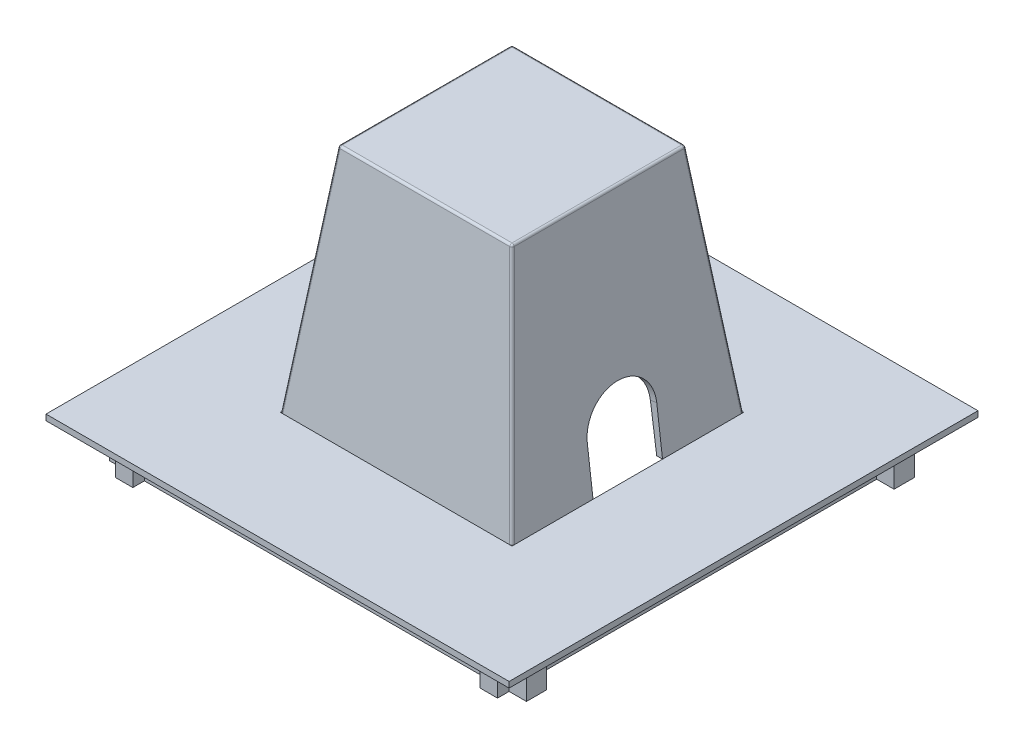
ISO-10303-21;
HEADER;
FILE_DESCRIPTION(('STEP AP214'),'2;1');
FILE_NAME('part.step','',(''),(''),'','','');
FILE_SCHEMA(('AUTOMOTIVE_DESIGN { 1 0 10303 214 1 1 1 1 }'));
ENDSEC;
DATA;
#1=APPLICATION_CONTEXT('core data for automotive mechanical design processes');
#2=APPLICATION_PROTOCOL_DEFINITION('international standard','automotive_design',2000,#1);
#3=PRODUCT_CONTEXT('',#1,'mechanical');
#4=PRODUCT('Part','Part','',(#3));
#5=PRODUCT_RELATED_PRODUCT_CATEGORY('part','',(#4));
#6=PRODUCT_DEFINITION_FORMATION('','',#4);
#7=PRODUCT_DEFINITION_CONTEXT('part definition',#1,'design');
#8=PRODUCT_DEFINITION('design','',#6,#7);
#9=PRODUCT_DEFINITION_SHAPE('','',#8);
#10=(LENGTH_UNIT() NAMED_UNIT(*) SI_UNIT(.MILLI.,.METRE.));
#11=(NAMED_UNIT(*) PLANE_ANGLE_UNIT() SI_UNIT($,.RADIAN.));
#12=(NAMED_UNIT(*) SI_UNIT($,.STERADIAN.) SOLID_ANGLE_UNIT());
#13=UNCERTAINTY_MEASURE_WITH_UNIT(LENGTH_MEASURE(1.E-05),#10,'distance_accuracy_value','');
#14=(GEOMETRIC_REPRESENTATION_CONTEXT(3) GLOBAL_UNCERTAINTY_ASSIGNED_CONTEXT((#13)) GLOBAL_UNIT_ASSIGNED_CONTEXT((#10,
#11,#12)) REPRESENTATION_CONTEXT('',''));
#15=CARTESIAN_POINT('',(0.,0.,0.));
#16=DIRECTION('',(0.,0.,1.));
#17=DIRECTION('',(1.,0.,0.));
#18=AXIS2_PLACEMENT_3D('',#15,#16,#17);
#19=CARTESIAN_POINT('',(7.99360577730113E-12,615.95,0.));
#20=DIRECTION('',(0.,1.,0.));
#21=DIRECTION('',(0.,0.,1.));
#22=AXIS2_PLACEMENT_3D('',#19,#20,#21);
#23=PLANE('',#22);
#24=DIRECTION('',(-1.,0.,0.));
#25=VECTOR('',#24,1.);
#26=CARTESIAN_POINT('',(0.,615.950000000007,649.565466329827));
#27=LINE('',#26,#25);
#28=CARTESIAN_POINT('',(-605.115466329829,615.950000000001,649.565466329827));
#29=VERTEX_POINT('',#28);
#30=CARTESIAN_POINT('',(-233.084533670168,615.95,649.565466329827));
#31=VERTEX_POINT('',#30);
#32=EDGE_CURVE('E518',#29,#31,#27,.F.);
#33=ORIENTED_EDGE('',*,*,#32,.T.);
#34=DIRECTION('',(0.,0.,1.));
#35=VECTOR('',#34,1.);
#36=CARTESIAN_POINT('',(-233.084533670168,615.95,0.));
#37=LINE('',#36,#35);
#38=CARTESIAN_POINT('',(-233.084533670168,615.95,277.534533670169));
#39=VERTEX_POINT('',#38);
#40=EDGE_CURVE('E274',#31,#39,#37,.F.);
#41=ORIENTED_EDGE('',*,*,#40,.T.);
#42=DIRECTION('',(1.,0.,0.));
#43=VECTOR('',#42,1.);
#44=CARTESIAN_POINT('',(0.,615.95,277.534533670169));
#45=LINE('',#44,#43);
#46=CARTESIAN_POINT('',(-605.115466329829,615.95,277.534533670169));
#47=VERTEX_POINT('',#46);
#48=EDGE_CURVE('E512',#39,#47,#45,.F.);
#49=ORIENTED_EDGE('',*,*,#48,.T.);
#50=DIRECTION('',(0.,0.,-1.));
#51=VECTOR('',#50,1.);
#52=CARTESIAN_POINT('',(-605.115466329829,615.95,0.));
#53=LINE('',#52,#51);
#54=EDGE_CURVE('E516',#47,#29,#53,.F.);
#55=ORIENTED_EDGE('',*,*,#54,.T.);
#56=EDGE_LOOP('',(#33,#41,#49,#55));
#57=FACE_BOUND('',#56,.T.);
#58=ADVANCED_FACE('F56',(#57),#23,.T.);
#59=CARTESIAN_POINT('',(7.99360577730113E-12,107.95,-1.77635683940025E-12));
#60=DIRECTION('',(0.,1.,0.));
#61=DIRECTION('',(0.,0.,1.));
#62=AXIS2_PLACEMENT_3D('',#59,#60,#61);
#63=PLANE('',#62);
#64=DIRECTION('',(0.,0.,-1.));
#65=VECTOR('',#64,1.);
#66=CARTESIAN_POINT('',(-165.099999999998,107.950000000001,717.549999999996));
#67=LINE('',#66,#65);
#68=CARTESIAN_POINT('',(-165.099999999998,107.949999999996,387.349999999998));
#69=VERTEX_POINT('',#68);
#70=CARTESIAN_POINT('',(-165.099999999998,107.949999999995,214.590771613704));
#71=VERTEX_POINT('',#70);
#72=EDGE_CURVE('E213',#69,#71,#67,.T.);
#73=ORIENTED_EDGE('',*,*,#72,.F.);
#74=DIRECTION('',(-1.,0.,0.));
#75=VECTOR('',#74,1.);
#76=CARTESIAN_POINT('',(7.99360577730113E-12,107.950000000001,387.349999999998));
#77=LINE('',#76,#75);
#78=CARTESIAN_POINT('',(-177.799999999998,107.949999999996,387.349999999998));
#79=VERTEX_POINT('',#78);
#80=EDGE_CURVE('E197',#69,#79,#77,.T.);
#81=ORIENTED_EDGE('',*,*,#80,.T.);
#82=DIRECTION('',(0.,0.,1.));
#83=VECTOR('',#82,1.);
#84=CARTESIAN_POINT('',(-177.799999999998,107.949999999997,222.249999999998));
#85=LINE('',#84,#83);
#86=CARTESIAN_POINT('',(-177.799999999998,107.949999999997,222.249999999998));
#87=VERTEX_POINT('',#86);
#88=EDGE_CURVE('E454',#87,#79,#85,.T.);
#89=ORIENTED_EDGE('',*,*,#88,.F.);
#90=DIRECTION('',(1.,0.,0.));
#91=VECTOR('',#90,1.);
#92=CARTESIAN_POINT('',(-177.799999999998,107.949999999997,222.249999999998));
#93=LINE('',#92,#91);
#94=CARTESIAN_POINT('',(-660.399999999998,107.949999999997,222.249999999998));
#95=VERTEX_POINT('',#94);
#96=EDGE_CURVE('E449',#95,#87,#93,.T.);
#97=ORIENTED_EDGE('',*,*,#96,.F.);
#98=DIRECTION('',(0.,0.,-1.));
#99=VECTOR('',#98,1.);
#100=CARTESIAN_POINT('',(-660.399999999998,107.949999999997,222.249999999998));
#101=LINE('',#100,#99);
#102=CARTESIAN_POINT('',(-660.399999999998,107.949999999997,704.849999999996));
#103=VERTEX_POINT('',#102);
#104=EDGE_CURVE('E82',#103,#95,#101,.T.);
#105=ORIENTED_EDGE('',*,*,#104,.F.);
#106=DIRECTION('',(-1.,0.,0.));
#107=VECTOR('',#106,1.);
#108=CARTESIAN_POINT('',(-177.799999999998,107.949999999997,704.849999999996));
#109=LINE('',#108,#107);
#110=CARTESIAN_POINT('',(-177.799999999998,107.949999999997,704.849999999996));
#111=VERTEX_POINT('',#110);
#112=EDGE_CURVE('E457',#111,#103,#109,.T.);
#113=ORIENTED_EDGE('',*,*,#112,.F.);
#114=CARTESIAN_POINT('',(-177.799999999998,107.949999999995,539.749999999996));
#115=VERTEX_POINT('',#114);
#116=EDGE_CURVE('E451',#115,#111,#85,.T.);
#117=ORIENTED_EDGE('',*,*,#116,.F.);
#118=DIRECTION('',(-1.,0.,0.));
#119=VECTOR('',#118,1.);
#120=CARTESIAN_POINT('',(7.99360577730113E-12,107.949999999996,539.749999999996));
#121=LINE('',#120,#119);
#122=CARTESIAN_POINT('',(-165.099999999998,107.949999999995,539.749999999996));
#123=VERTEX_POINT('',#122);
#124=EDGE_CURVE('E206',#123,#115,#121,.T.);
#125=ORIENTED_EDGE('',*,*,#124,.F.);
#126=CARTESIAN_POINT('',(-165.099999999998,107.949999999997,712.509228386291));
#127=VERTEX_POINT('',#126);
#128=EDGE_CURVE('E60',#127,#123,#67,.T.);
#129=ORIENTED_EDGE('',*,*,#128,.F.);
#130=CARTESIAN_POINT('',(-170.219533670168,107.949999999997,712.430466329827));
#131=DIRECTION('',(0.,1.,0.));
#132=DIRECTION('',(-0.707106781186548,0.,-0.707106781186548));
#133=AXIS2_PLACEMENT_3D('',#130,#131,#132);
#134=ELLIPSE('',#133,5.15876438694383,5.07999999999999);
#135=CARTESIAN_POINT('',(-170.140771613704,107.950000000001,717.549999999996));
#136=VERTEX_POINT('',#135);
#137=EDGE_CURVE('E370',#127,#136,#134,.F.);
#138=ORIENTED_EDGE('',*,*,#137,.T.);
#139=DIRECTION('',(1.,0.,0.));
#140=VECTOR('',#139,1.);
#141=CARTESIAN_POINT('',(-673.099999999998,107.950000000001,717.549999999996));
#142=LINE('',#141,#140);
#143=CARTESIAN_POINT('',(-668.059228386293,107.950000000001,717.549999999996));
#144=VERTEX_POINT('',#143);
#145=EDGE_CURVE('E216',#144,#136,#142,.T.);
#146=ORIENTED_EDGE('',*,*,#145,.F.);
#147=CARTESIAN_POINT('',(-667.980466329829,107.949999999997,712.430466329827));
#148=DIRECTION('',(0.,1.,0.));
#149=DIRECTION('',(0.707106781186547,0.,-0.707106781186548));
#150=AXIS2_PLACEMENT_3D('',#147,#148,#149);
#151=ELLIPSE('',#150,5.15876438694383,5.07999999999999);
#152=CARTESIAN_POINT('',(-673.099999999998,107.949999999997,712.509228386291));
#153=VERTEX_POINT('',#152);
#154=EDGE_CURVE('E367',#144,#153,#151,.F.);
#155=ORIENTED_EDGE('',*,*,#154,.T.);
#156=DIRECTION('',(0.,0.,1.));
#157=VECTOR('',#156,1.);
#158=CARTESIAN_POINT('',(-673.099999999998,107.949999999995,209.549999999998));
#159=LINE('',#158,#157);
#160=CARTESIAN_POINT('',(-673.099999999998,107.949999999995,214.590771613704));
#161=VERTEX_POINT('',#160);
#162=EDGE_CURVE('E288',#161,#153,#159,.T.);
#163=ORIENTED_EDGE('',*,*,#162,.F.);
#164=CARTESIAN_POINT('',(-667.980466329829,107.949999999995,214.669533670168));
#165=DIRECTION('',(0.,1.,0.));
#166=DIRECTION('',(0.707106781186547,0.,0.707106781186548));
#167=AXIS2_PLACEMENT_3D('',#164,#165,#166);
#168=ELLIPSE('',#167,5.15876438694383,5.07999999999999);
#169=CARTESIAN_POINT('',(-668.059228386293,107.949999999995,209.549999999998));
#170=VERTEX_POINT('',#169);
#171=EDGE_CURVE('E373',#161,#170,#168,.F.);
#172=ORIENTED_EDGE('',*,*,#171,.T.);
#173=DIRECTION('',(-1.,0.,0.));
#174=VECTOR('',#173,1.);
#175=CARTESIAN_POINT('',(-165.099999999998,107.949999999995,209.549999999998));
#176=LINE('',#175,#174);
#177=CARTESIAN_POINT('',(-170.140771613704,107.949999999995,209.549999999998));
#178=VERTEX_POINT('',#177);
#179=EDGE_CURVE('E428',#178,#170,#176,.T.);
#180=ORIENTED_EDGE('',*,*,#179,.F.);
#181=CARTESIAN_POINT('',(-170.219533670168,107.949999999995,214.669533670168));
#182=DIRECTION('',(0.,1.,0.));
#183=DIRECTION('',(-0.707106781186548,0.,0.707106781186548));
#184=AXIS2_PLACEMENT_3D('',#181,#182,#183);
#185=ELLIPSE('',#184,5.15876438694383,5.07999999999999);
#186=EDGE_CURVE('E385',#178,#71,#185,.F.);
#187=ORIENTED_EDGE('',*,*,#186,.T.);
#188=EDGE_LOOP('',(#73,#81,#89,#97,#105,#113,#117,#125,#129,#138,#146,#155,#163,#172,#180,#187));
#189=FACE_BOUND('',#188,.T.);
#190=ADVANCED_FACE('F233',(#189),#63,.F.);
#191=CARTESIAN_POINT('',(0.,-24.1300000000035,193.04));
#192=DIRECTION('',(0.,0.124034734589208,-0.992277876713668));
#193=DIRECTION('',(0.,0.992277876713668,0.124034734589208));
#194=AXIS2_PLACEMENT_3D('',#191,#192,#193);
#195=PLANE('',#194);
#196=DIRECTION('',(1.,0.,0.));
#197=VECTOR('',#196,1.);
#198=CARTESIAN_POINT('',(7.99360577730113E-12,611.500096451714,272.493762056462));
#199=LINE('',#198,#197);
#200=CARTESIAN_POINT('',(-605.115466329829,611.500096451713,272.493762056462));
#201=VERTEX_POINT('',#200);
#202=CARTESIAN_POINT('',(-233.084533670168,611.500096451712,272.493762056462));
#203=VERTEX_POINT('',#202);
#204=EDGE_CURVE('E375',#201,#203,#199,.T.);
#205=ORIENTED_EDGE('',*,*,#204,.T.);
#206=DIRECTION('',(-0.123091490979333,0.984731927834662,0.123091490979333));
#207=VECTOR('',#206,1.);
#208=CARTESIAN_POINT('',(-151.303032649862,-42.7519117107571,190.712261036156));
#209=LINE('',#208,#207);
#210=EDGE_CURVE('E371',#203,#178,#209,.F.);
#211=ORIENTED_EDGE('',*,*,#210,.T.);
#212=ORIENTED_EDGE('',*,*,#179,.T.);
#213=DIRECTION('',(0.123091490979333,0.984731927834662,0.123091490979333));
#214=VECTOR('',#213,1.);
#215=CARTESIAN_POINT('',(-674.196967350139,58.8480882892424,203.412261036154));
#216=LINE('',#215,#214);
#217=EDGE_CURVE('E547',#170,#201,#216,.T.);
#218=ORIENTED_EDGE('',*,*,#217,.T.);
#219=EDGE_LOOP('',(#205,#211,#212,#218));
#220=FACE_BOUND('',#219,.T.);
#221=ADVANCED_FACE('F243',(#220),#195,.T.);
#222=CARTESIAN_POINT('',(-149.273846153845,-18.6592307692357,0.));
#223=DIRECTION('',(0.992277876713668,0.124034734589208,0.));
#224=DIRECTION('',(-0.124034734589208,0.992277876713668,0.));
#225=AXIS2_PLACEMENT_3D('',#222,#223,#224);
#226=PLANE('',#225);
#227=DIRECTION('',(-0.124034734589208,0.992277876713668,0.));
#228=VECTOR('',#227,1.);
#229=CARTESIAN_POINT('',(-165.099999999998,107.949999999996,387.349999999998));
#230=LINE('',#229,#228);
#231=CARTESIAN_POINT('',(-177.701929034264,208.765432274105,387.35));
#232=VERTEX_POINT('',#231);
#233=EDGE_CURVE('E194',#69,#232,#230,.T.);
#234=ORIENTED_EDGE('',*,*,#233,.F.);
#235=ORIENTED_EDGE('',*,*,#72,.T.);
#236=DIRECTION('',(-0.123091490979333,0.984731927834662,0.123091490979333));
#237=VECTOR('',#236,1.);
#238=CARTESIAN_POINT('',(-146.262261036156,-42.7519117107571,195.753032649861));
#239=LINE('',#238,#237);
#240=CARTESIAN_POINT('',(-228.043762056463,611.500096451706,277.534533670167));
#241=VERTEX_POINT('',#240);
#242=EDGE_CURVE('E506',#71,#241,#239,.T.);
#243=ORIENTED_EDGE('',*,*,#242,.T.);
#244=DIRECTION('',(0.,0.,1.));
#245=VECTOR('',#244,1.);
#246=CARTESIAN_POINT('',(-228.043762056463,611.500096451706,-2.22044604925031E-12));
#247=LINE('',#246,#245);
#248=CARTESIAN_POINT('',(-228.043762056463,611.50009645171,649.565466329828));
#249=VERTEX_POINT('',#248);
#250=EDGE_CURVE('E504',#241,#249,#247,.T.);
#251=ORIENTED_EDGE('',*,*,#250,.T.);
#252=DIRECTION('',(-0.123091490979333,0.984731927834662,-0.123091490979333));
#253=VECTOR('',#252,1.);
#254=CARTESIAN_POINT('',(-160.309230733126,69.6238458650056,717.299997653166));
#255=LINE('',#254,#253);
#256=EDGE_CURVE('E498',#249,#127,#255,.F.);
#257=ORIENTED_EDGE('',*,*,#256,.T.);
#258=ORIENTED_EDGE('',*,*,#128,.T.);
#259=DIRECTION('',(-0.124034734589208,0.992277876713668,0.));
#260=VECTOR('',#259,1.);
#261=CARTESIAN_POINT('',(-165.099999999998,107.949999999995,539.749999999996));
#262=LINE('',#261,#260);
#263=CARTESIAN_POINT('',(-177.701929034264,208.765432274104,539.749999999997));
#264=VERTEX_POINT('',#263);
#265=EDGE_CURVE('E191',#123,#264,#262,.T.);
#266=ORIENTED_EDGE('',*,*,#265,.T.);
#267=CARTESIAN_POINT('',(-177.701929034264,208.765432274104,463.549999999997));
#268=DIRECTION('',(0.992277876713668,0.124034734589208,0.));
#269=DIRECTION('',(-0.124034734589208,0.992277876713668,0.));
#270=AXIS2_PLACEMENT_3D('',#267,#268,#269);
#271=CIRCLE('',#270,76.2);
#272=EDGE_CURVE('E186',#232,#264,#271,.T.);
#273=ORIENTED_EDGE('',*,*,#272,.F.);
#274=EDGE_LOOP('',(#234,#235,#243,#251,#257,#258,#266,#273));
#275=FACE_BOUND('',#274,.T.);
#276=ADVANCED_FACE('F201',(#275),#226,.T.);
#277=CARTESIAN_POINT('',(-676.030769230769,84.5038461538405,0.));
#278=DIRECTION('',(-0.992277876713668,0.124034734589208,0.));
#279=DIRECTION('',(-0.124034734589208,-0.992277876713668,0.));
#280=AXIS2_PLACEMENT_3D('',#277,#278,#279);
#281=PLANE('',#280);
#282=DIRECTION('',(0.,0.,-1.));
#283=VECTOR('',#282,1.);
#284=CARTESIAN_POINT('',(-610.156237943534,611.500096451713,-2.22044604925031E-12));
#285=LINE('',#284,#283);
#286=CARTESIAN_POINT('',(-610.156237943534,611.500096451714,649.565466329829));
#287=VERTEX_POINT('',#286);
#288=CARTESIAN_POINT('',(-610.156237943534,611.500096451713,277.534533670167));
#289=VERTEX_POINT('',#288);
#290=EDGE_CURVE('E541',#287,#289,#285,.T.);
#291=ORIENTED_EDGE('',*,*,#290,.T.);
#292=DIRECTION('',(0.123091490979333,0.984731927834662,0.123091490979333));
#293=VECTOR('',#292,1.);
#294=CARTESIAN_POINT('',(-679.237738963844,58.8480882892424,208.453032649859));
#295=LINE('',#294,#293);
#296=EDGE_CURVE('E545',#289,#161,#295,.F.);
#297=ORIENTED_EDGE('',*,*,#296,.T.);
#298=ORIENTED_EDGE('',*,*,#162,.T.);
#299=DIRECTION('',(0.123091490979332,0.984731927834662,-0.123091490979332));
#300=VECTOR('',#299,1.);
#301=CARTESIAN_POINT('',(-665.190769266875,171.223845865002,704.599997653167));
#302=LINE('',#301,#300);
#303=EDGE_CURVE('E280',#153,#287,#302,.T.);
#304=ORIENTED_EDGE('',*,*,#303,.T.);
#305=EDGE_LOOP('',(#291,#297,#298,#304));
#306=FACE_BOUND('',#305,.T.);
#307=ADVANCED_FACE('F302',(#306),#281,.T.);
#308=CARTESIAN_POINT('',(7.99360577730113E-12,89.9746153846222,719.79692307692));
#309=DIRECTION('',(0.,0.124034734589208,0.992277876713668));
#310=DIRECTION('',(0.,-0.992277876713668,0.124034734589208));
#311=AXIS2_PLACEMENT_3D('',#308,#309,#310);
#312=PLANE('',#311);
#313=ORIENTED_EDGE('',*,*,#145,.T.);
#314=DIRECTION('',(-0.123091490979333,0.984731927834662,-0.123091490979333));
#315=VECTOR('',#314,1.);
#316=CARTESIAN_POINT('',(-165.350002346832,69.6238458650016,722.340769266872));
#317=LINE('',#316,#315);
#318=CARTESIAN_POINT('',(-233.084533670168,611.500096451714,654.606237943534));
#319=VERTEX_POINT('',#318);
#320=EDGE_CURVE('E278',#136,#319,#317,.T.);
#321=ORIENTED_EDGE('',*,*,#320,.T.);
#322=DIRECTION('',(-1.,0.,0.));
#323=VECTOR('',#322,1.);
#324=CARTESIAN_POINT('',(0.,611.500096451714,654.606237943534));
#325=LINE('',#324,#323);
#326=CARTESIAN_POINT('',(-605.115466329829,611.500096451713,654.606237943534));
#327=VERTEX_POINT('',#326);
#328=EDGE_CURVE('E273',#319,#327,#325,.T.);
#329=ORIENTED_EDGE('',*,*,#328,.T.);
#330=DIRECTION('',(0.123091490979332,0.984731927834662,-0.123091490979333));
#331=VECTOR('',#330,1.);
#332=CARTESIAN_POINT('',(-660.14999765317,171.223845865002,709.640769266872));
#333=LINE('',#332,#331);
#334=EDGE_CURVE('E271',#327,#144,#333,.F.);
#335=ORIENTED_EDGE('',*,*,#334,.T.);
#336=EDGE_LOOP('',(#313,#321,#329,#335));
#337=FACE_BOUND('',#336,.T.);
#338=ADVANCED_FACE('F310',(#337),#312,.T.);
#339=CARTESIAN_POINT('',(-674.196967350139,58.217991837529,208.453032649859));
#340=DIRECTION('',(0.123091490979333,0.984731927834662,0.123091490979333));
#341=DIRECTION('',(0.,-0.124034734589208,0.992277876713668));
#342=AXIS2_PLACEMENT_3D('',#339,#340,#341);
#343=CYLINDRICAL_SURFACE('',#342,5.07999999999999);
#344=ORIENTED_EDGE('',*,*,#171,.F.);
#345=ORIENTED_EDGE('',*,*,#296,.F.);
#346=CARTESIAN_POINT('',(-605.115466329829,610.869999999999,277.534533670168));
#347=DIRECTION('',(0.123091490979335,0.984731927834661,0.123091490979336));
#348=DIRECTION('',(0.,-0.124034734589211,0.992277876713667));
#349=AXIS2_PLACEMENT_3D('',#346,#347,#348);
#350=CIRCLE('',#349,5.07999999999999);
#351=EDGE_CURVE('E420',#201,#289,#350,.T.);
#352=ORIENTED_EDGE('',*,*,#351,.F.);
#353=ORIENTED_EDGE('',*,*,#217,.F.);
#354=EDGE_LOOP('',(#344,#345,#352,#353));
#355=FACE_BOUND('',#354,.T.);
#356=ADVANCED_FACE('F58',(#355),#343,.T.);
#357=CARTESIAN_POINT('',(-660.14999765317,170.593749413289,704.599997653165));
#358=DIRECTION('',(0.123091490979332,0.984731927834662,-0.123091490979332));
#359=DIRECTION('',(0.,0.124034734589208,0.992277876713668));
#360=AXIS2_PLACEMENT_3D('',#357,#358,#359);
#361=CYLINDRICAL_SURFACE('',#360,5.07999999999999);
#362=ORIENTED_EDGE('',*,*,#154,.F.);
#363=ORIENTED_EDGE('',*,*,#334,.F.);
#364=CARTESIAN_POINT('',(-605.115466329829,610.87,649.565466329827));
#365=DIRECTION('',(0.123091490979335,0.984731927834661,-0.123091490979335));
#366=DIRECTION('',(0.,0.124034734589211,0.992277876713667));
#367=AXIS2_PLACEMENT_3D('',#364,#365,#366);
#368=CIRCLE('',#367,5.07999999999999);
#369=EDGE_CURVE('E418',#287,#327,#368,.T.);
#370=ORIENTED_EDGE('',*,*,#369,.F.);
#371=ORIENTED_EDGE('',*,*,#303,.F.);
#372=EDGE_LOOP('',(#362,#363,#370,#371));
#373=FACE_BOUND('',#372,.T.);
#374=ADVANCED_FACE('F358',(#373),#361,.T.);
#375=CARTESIAN_POINT('',(-605.115466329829,610.869999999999,-1.77635683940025E-12));
#376=DIRECTION('',(0.,0.,-1.));
#377=DIRECTION('',(-1.,0.,0.));
#378=AXIS2_PLACEMENT_3D('',#375,#376,#377);
#379=CYLINDRICAL_SURFACE('',#378,5.07999999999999);
#380=CARTESIAN_POINT('',(-605.115466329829,610.869999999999,277.534533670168));
#381=DIRECTION('',(0.,0.,-1.));
#382=DIRECTION('',(-1.,0.,0.));
#383=AXIS2_PLACEMENT_3D('',#380,#381,#382);
#384=CIRCLE('',#383,5.07999999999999);
#385=EDGE_CURVE('E423',#289,#47,#384,.T.);
#386=ORIENTED_EDGE('',*,*,#385,.F.);
#387=ORIENTED_EDGE('',*,*,#290,.F.);
#388=CARTESIAN_POINT('',(-605.115466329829,610.87,649.565466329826));
#389=DIRECTION('',(0.,0.,1.));
#390=DIRECTION('',(1.,0.,0.));
#391=AXIS2_PLACEMENT_3D('',#388,#389,#390);
#392=CIRCLE('',#391,5.07999999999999);
#393=EDGE_CURVE('E415',#29,#287,#392,.T.);
#394=ORIENTED_EDGE('',*,*,#393,.F.);
#395=ORIENTED_EDGE('',*,*,#54,.F.);
#396=EDGE_LOOP('',(#386,#387,#394,#395));
#397=FACE_BOUND('',#396,.T.);
#398=ADVANCED_FACE('F355',(#397),#379,.T.);
#399=CARTESIAN_POINT('',(-605.115466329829,610.869999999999,277.534533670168));
#400=DIRECTION('',(0.,0.,1.));
#401=DIRECTION('',(1.,0.,0.));
#402=AXIS2_PLACEMENT_3D('',#399,#400,#401);
#403=SPHERICAL_SURFACE('',#402,5.07999999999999);
#404=ORIENTED_EDGE('',*,*,#351,.T.);
#405=ORIENTED_EDGE('',*,*,#385,.T.);
#406=CARTESIAN_POINT('',(-605.115466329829,610.869999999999,277.534533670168));
#407=DIRECTION('',(-1.,0.,0.));
#408=DIRECTION('',(0.,0.,1.));
#409=AXIS2_PLACEMENT_3D('',#406,#407,#408);
#410=CIRCLE('',#409,5.07999999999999);
#411=EDGE_CURVE('E412',#201,#47,#410,.F.);
#412=ORIENTED_EDGE('',*,*,#411,.F.);
#413=EDGE_LOOP('',(#404,#405,#412));
#414=FACE_BOUND('',#413,.T.);
#415=ADVANCED_FACE('F351',(#414),#403,.T.);
#416=CARTESIAN_POINT('',(-605.115466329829,610.87,649.565466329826));
#417=DIRECTION('',(0.,0.,1.));
#418=DIRECTION('',(1.,0.,0.));
#419=AXIS2_PLACEMENT_3D('',#416,#417,#418);
#420=SPHERICAL_SURFACE('',#419,5.07999999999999);
#421=ORIENTED_EDGE('',*,*,#393,.T.);
#422=ORIENTED_EDGE('',*,*,#369,.T.);
#423=CARTESIAN_POINT('',(-605.115466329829,610.87,649.565466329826));
#424=DIRECTION('',(-1.,0.,0.));
#425=DIRECTION('',(0.,-1.,0.));
#426=AXIS2_PLACEMENT_3D('',#423,#424,#425);
#427=CIRCLE('',#426,5.07999999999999);
#428=EDGE_CURVE('E409',#29,#327,#427,.F.);
#429=ORIENTED_EDGE('',*,*,#428,.F.);
#430=EDGE_LOOP('',(#421,#422,#429));
#431=FACE_BOUND('',#430,.T.);
#432=ADVANCED_FACE('F347',(#431),#420,.T.);
#433=CARTESIAN_POINT('',(7.99360577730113E-12,610.87,277.534533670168));
#434=DIRECTION('',(1.,0.,0.));
#435=DIRECTION('',(0.,0.,-1.));
#436=AXIS2_PLACEMENT_3D('',#433,#434,#435);
#437=CYLINDRICAL_SURFACE('',#436,5.07999999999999);
#438=ORIENTED_EDGE('',*,*,#411,.T.);
#439=ORIENTED_EDGE('',*,*,#48,.F.);
#440=CARTESIAN_POINT('',(-233.084533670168,610.869999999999,277.534533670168));
#441=DIRECTION('',(1.,0.,0.));
#442=DIRECTION('',(0.,0.,-1.));
#443=AXIS2_PLACEMENT_3D('',#440,#441,#442);
#444=CIRCLE('',#443,5.07999999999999);
#445=EDGE_CURVE('E406',#203,#39,#444,.T.);
#446=ORIENTED_EDGE('',*,*,#445,.F.);
#447=ORIENTED_EDGE('',*,*,#204,.F.);
#448=EDGE_LOOP('',(#438,#439,#446,#447));
#449=FACE_BOUND('',#448,.T.);
#450=ADVANCED_FACE('F343',(#449),#437,.T.);
#451=CARTESIAN_POINT('',(-151.303032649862,-43.3820081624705,195.753032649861));
#452=DIRECTION('',(-0.123091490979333,0.984731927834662,0.123091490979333));
#453=DIRECTION('',(0.,-0.124034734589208,0.992277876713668));
#454=AXIS2_PLACEMENT_3D('',#451,#452,#453);
#455=CYLINDRICAL_SURFACE('',#454,5.07999999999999);
#456=ORIENTED_EDGE('',*,*,#186,.F.);
#457=ORIENTED_EDGE('',*,*,#210,.F.);
#458=CARTESIAN_POINT('',(-233.084533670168,610.869999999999,277.534533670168));
#459=DIRECTION('',(-0.123091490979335,0.984731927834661,0.123091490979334));
#460=DIRECTION('',(-0.992277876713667,-0.124034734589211,0.));
#461=AXIS2_PLACEMENT_3D('',#458,#459,#460);
#462=CIRCLE('',#461,5.07999999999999);
#463=EDGE_CURVE('E403',#241,#203,#462,.T.);
#464=ORIENTED_EDGE('',*,*,#463,.F.);
#465=ORIENTED_EDGE('',*,*,#242,.F.);
#466=EDGE_LOOP('',(#456,#457,#464,#465));
#467=FACE_BOUND('',#466,.T.);
#468=ADVANCED_FACE('F339',(#467),#455,.T.);
#469=CARTESIAN_POINT('',(-165.350002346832,68.9937494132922,717.299997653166));
#470=DIRECTION('',(-0.123091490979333,0.984731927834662,-0.123091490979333));
#471=DIRECTION('',(0.,0.124034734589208,0.992277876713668));
#472=AXIS2_PLACEMENT_3D('',#469,#470,#471);
#473=CYLINDRICAL_SURFACE('',#472,5.07999999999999);
#474=ORIENTED_EDGE('',*,*,#137,.F.);
#475=ORIENTED_EDGE('',*,*,#256,.F.);
#476=CARTESIAN_POINT('',(-233.084533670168,610.87,649.565466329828));
#477=DIRECTION('',(-0.123091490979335,0.984731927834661,-0.123091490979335));
#478=DIRECTION('',(0.,0.124034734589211,0.992277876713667));
#479=AXIS2_PLACEMENT_3D('',#476,#477,#478);
#480=CIRCLE('',#479,5.07999999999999);
#481=EDGE_CURVE('E400',#319,#249,#480,.T.);
#482=ORIENTED_EDGE('',*,*,#481,.F.);
#483=ORIENTED_EDGE('',*,*,#320,.F.);
#484=EDGE_LOOP('',(#474,#475,#482,#483));
#485=FACE_BOUND('',#484,.T.);
#486=ADVANCED_FACE('F335',(#485),#473,.T.);
#487=CARTESIAN_POINT('',(0.,610.870000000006,649.565466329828));
#488=DIRECTION('',(-1.,0.,0.));
#489=DIRECTION('',(0.,0.,1.));
#490=AXIS2_PLACEMENT_3D('',#487,#488,#489);
#491=CYLINDRICAL_SURFACE('',#490,5.07999999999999);
#492=ORIENTED_EDGE('',*,*,#428,.T.);
#493=ORIENTED_EDGE('',*,*,#328,.F.);
#494=CARTESIAN_POINT('',(-233.084533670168,610.87,649.565466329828));
#495=DIRECTION('',(1.,0.,0.));
#496=DIRECTION('',(0.,0.,-1.));
#497=AXIS2_PLACEMENT_3D('',#494,#495,#496);
#498=CIRCLE('',#497,5.07999999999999);
#499=EDGE_CURVE('E397',#31,#319,#498,.T.);
#500=ORIENTED_EDGE('',*,*,#499,.F.);
#501=ORIENTED_EDGE('',*,*,#32,.F.);
#502=EDGE_LOOP('',(#492,#493,#500,#501));
#503=FACE_BOUND('',#502,.T.);
#504=ADVANCED_FACE('F331',(#503),#491,.T.);
#505=CARTESIAN_POINT('',(-233.084533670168,610.869999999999,277.534533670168));
#506=DIRECTION('',(0.,0.,1.));
#507=DIRECTION('',(1.,0.,0.));
#508=AXIS2_PLACEMENT_3D('',#505,#506,#507);
#509=SPHERICAL_SURFACE('',#508,5.07999999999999);
#510=ORIENTED_EDGE('',*,*,#463,.T.);
#511=ORIENTED_EDGE('',*,*,#445,.T.);
#512=CARTESIAN_POINT('',(-233.084533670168,610.869999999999,277.534533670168));
#513=DIRECTION('',(0.,0.,-1.));
#514=DIRECTION('',(-1.,0.,0.));
#515=AXIS2_PLACEMENT_3D('',#512,#513,#514);
#516=CIRCLE('',#515,5.07999999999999);
#517=EDGE_CURVE('E394',#241,#39,#516,.F.);
#518=ORIENTED_EDGE('',*,*,#517,.F.);
#519=EDGE_LOOP('',(#510,#511,#518));
#520=FACE_BOUND('',#519,.T.);
#521=ADVANCED_FACE('F327',(#520),#509,.T.);
#522=CARTESIAN_POINT('',(-233.084533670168,610.87,649.565466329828));
#523=DIRECTION('',(0.,0.,1.));
#524=DIRECTION('',(1.,0.,0.));
#525=AXIS2_PLACEMENT_3D('',#522,#523,#524);
#526=SPHERICAL_SURFACE('',#525,5.07999999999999);
#527=ORIENTED_EDGE('',*,*,#499,.T.);
#528=ORIENTED_EDGE('',*,*,#481,.T.);
#529=CARTESIAN_POINT('',(-233.084533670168,610.87,649.565466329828));
#530=DIRECTION('',(0.,0.,1.));
#531=DIRECTION('',(1.,0.,0.));
#532=AXIS2_PLACEMENT_3D('',#529,#530,#531);
#533=CIRCLE('',#532,5.07999999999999);
#534=EDGE_CURVE('E392',#31,#249,#533,.F.);
#535=ORIENTED_EDGE('',*,*,#534,.F.);
#536=EDGE_LOOP('',(#527,#528,#535));
#537=FACE_BOUND('',#536,.T.);
#538=ADVANCED_FACE('F323',(#537),#526,.T.);
#539=CARTESIAN_POINT('',(-233.084533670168,610.869999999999,-1.77635683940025E-12));
#540=DIRECTION('',(0.,0.,1.));
#541=DIRECTION('',(1.,0.,0.));
#542=AXIS2_PLACEMENT_3D('',#539,#540,#541);
#543=CYLINDRICAL_SURFACE('',#542,5.07999999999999);
#544=ORIENTED_EDGE('',*,*,#517,.T.);
#545=ORIENTED_EDGE('',*,*,#40,.F.);
#546=ORIENTED_EDGE('',*,*,#534,.T.);
#547=ORIENTED_EDGE('',*,*,#250,.F.);
#548=EDGE_LOOP('',(#544,#545,#546,#547));
#549=FACE_BOUND('',#548,.T.);
#550=ADVANCED_FACE('F319',(#549),#543,.T.);
#551=CARTESIAN_POINT('',(-660.399999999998,107.949999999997,222.249999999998));
#552=DIRECTION('',(-0.99026806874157,0.139173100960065,0.));
#553=DIRECTION('',(-0.139173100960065,-0.99026806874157,0.));
#554=AXIS2_PLACEMENT_3D('',#551,#552,#553);
#555=PLANE('',#554);
#556=ORIENTED_EDGE('',*,*,#104,.T.);
#557=DIRECTION('',(-0.137844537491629,-0.980814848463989,-0.137844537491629));
#558=VECTOR('',#557,1.);
#559=CARTESIAN_POINT('',(-660.399999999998,107.949999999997,222.249999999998));
#560=LINE('',#559,#558);
#561=CARTESIAN_POINT('',(-595.430782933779,570.230000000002,287.219217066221));
#562=VERTEX_POINT('',#561);
#563=EDGE_CURVE('E463',#562,#95,#560,.T.);
#564=ORIENTED_EDGE('',*,*,#563,.F.);
#565=DIRECTION('',(0.,0.,-1.));
#566=VECTOR('',#565,1.);
#567=CARTESIAN_POINT('',(-595.430782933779,570.23,0.));
#568=LINE('',#567,#566);
#569=CARTESIAN_POINT('',(-595.430782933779,570.229999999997,639.880782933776));
#570=VERTEX_POINT('',#569);
#571=EDGE_CURVE('E460',#570,#562,#568,.T.);
#572=ORIENTED_EDGE('',*,*,#571,.F.);
#573=DIRECTION('',(-0.137844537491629,-0.980814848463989,0.137844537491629));
#574=VECTOR('',#573,1.);
#575=CARTESIAN_POINT('',(-651.230061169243,173.197505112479,695.68006116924));
#576=LINE('',#575,#574);
#577=EDGE_CURVE('E395',#570,#103,#576,.T.);
#578=ORIENTED_EDGE('',*,*,#577,.T.);
#579=EDGE_LOOP('',(#556,#564,#572,#578));
#580=FACE_BOUND('',#579,.T.);
#581=ADVANCED_FACE('F322',(#580),#555,.F.);
#582=CARTESIAN_POINT('',(-177.799999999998,107.949999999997,704.849999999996));
#583=DIRECTION('',(0.,0.139173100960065,0.99026806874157));
#584=DIRECTION('',(0.,-0.99026806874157,0.139173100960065));
#585=AXIS2_PLACEMENT_3D('',#582,#583,#584);
#586=PLANE('',#585);
#587=ORIENTED_EDGE('',*,*,#112,.T.);
#588=ORIENTED_EDGE('',*,*,#577,.F.);
#589=DIRECTION('',(-1.,0.,0.));
#590=VECTOR('',#589,1.);
#591=CARTESIAN_POINT('',(7.54951656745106E-12,570.230000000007,639.880782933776));
#592=LINE('',#591,#590);
#593=CARTESIAN_POINT('',(-242.769217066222,570.23,639.880782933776));
#594=VERTEX_POINT('',#593);
#595=EDGE_CURVE('E466',#594,#570,#592,.T.);
#596=ORIENTED_EDGE('',*,*,#595,.F.);
#597=DIRECTION('',(0.137844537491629,-0.980814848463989,0.137844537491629));
#598=VECTOR('',#597,1.);
#599=CARTESIAN_POINT('',(-186.969938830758,173.197505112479,695.68006116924));
#600=LINE('',#599,#598);
#601=EDGE_CURVE('E462',#594,#111,#600,.T.);
#602=ORIENTED_EDGE('',*,*,#601,.T.);
#603=EDGE_LOOP('',(#587,#588,#596,#602));
#604=FACE_BOUND('',#603,.T.);
#605=ADVANCED_FACE('F245',(#604),#586,.F.);
#606=CARTESIAN_POINT('',(-177.799999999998,107.949999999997,222.249999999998));
#607=DIRECTION('',(0.99026806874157,0.139173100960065,0.));
#608=DIRECTION('',(-0.139173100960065,0.99026806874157,0.));
#609=AXIS2_PLACEMENT_3D('',#606,#607,#608);
#610=PLANE('',#609);
#611=ORIENTED_EDGE('',*,*,#88,.T.);
#612=DIRECTION('',(-0.139173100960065,0.99026806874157,0.));
#613=VECTOR('',#612,1.);
#614=CARTESIAN_POINT('',(-177.799999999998,107.949999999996,387.349999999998));
#615=LINE('',#614,#613);
#616=CARTESIAN_POINT('',(-191.722379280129,207.012875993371,387.35));
#617=VERTEX_POINT('',#616);
#618=EDGE_CURVE('E13',#79,#617,#615,.T.);
#619=ORIENTED_EDGE('',*,*,#618,.T.);
#620=CARTESIAN_POINT('',(-191.722379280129,207.01287599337,463.549999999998));
#621=DIRECTION('',(0.99026806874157,0.139173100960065,0.));
#622=DIRECTION('',(0.139173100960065,-0.99026806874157,0.));
#623=AXIS2_PLACEMENT_3D('',#620,#621,#622);
#624=ELLIPSE('',#623,76.2088863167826,76.2);
#625=CARTESIAN_POINT('',(-191.722379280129,207.01287599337,539.749999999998));
#626=VERTEX_POINT('',#625);
#627=EDGE_CURVE('E189',#617,#626,#624,.T.);
#628=ORIENTED_EDGE('',*,*,#627,.T.);
#629=DIRECTION('',(-0.139173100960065,0.99026806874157,0.));
#630=VECTOR('',#629,1.);
#631=CARTESIAN_POINT('',(-177.799999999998,107.949999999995,539.749999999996));
#632=LINE('',#631,#630);
#633=EDGE_CURVE('E66',#115,#626,#632,.T.);
#634=ORIENTED_EDGE('',*,*,#633,.F.);
#635=ORIENTED_EDGE('',*,*,#116,.T.);
#636=ORIENTED_EDGE('',*,*,#601,.F.);
#637=DIRECTION('',(0.,0.,1.));
#638=VECTOR('',#637,1.);
#639=CARTESIAN_POINT('',(-242.769217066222,570.229999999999,0.));
#640=LINE('',#639,#638);
#641=CARTESIAN_POINT('',(-242.769217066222,570.23,287.219217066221));
#642=VERTEX_POINT('',#641);
#643=EDGE_CURVE('E475',#642,#594,#640,.T.);
#644=ORIENTED_EDGE('',*,*,#643,.F.);
#645=DIRECTION('',(0.137844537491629,-0.980814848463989,-0.137844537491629));
#646=VECTOR('',#645,1.);
#647=CARTESIAN_POINT('',(-177.799999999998,107.949999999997,222.249999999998));
#648=LINE('',#647,#646);
#649=EDGE_CURVE('E465',#642,#87,#648,.T.);
#650=ORIENTED_EDGE('',*,*,#649,.T.);
#651=EDGE_LOOP('',(#611,#619,#628,#634,#635,#636,#644,#650));
#652=FACE_BOUND('',#651,.T.);
#653=ADVANCED_FACE('F486',(#652),#610,.F.);
#654=CARTESIAN_POINT('',(-177.799999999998,107.949999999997,222.249999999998));
#655=DIRECTION('',(0.,0.139173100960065,-0.99026806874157));
#656=DIRECTION('',(0.,0.99026806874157,0.139173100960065));
#657=AXIS2_PLACEMENT_3D('',#654,#655,#656);
#658=PLANE('',#657);
#659=ORIENTED_EDGE('',*,*,#96,.T.);
#660=ORIENTED_EDGE('',*,*,#649,.F.);
#661=DIRECTION('',(1.,0.,0.));
#662=VECTOR('',#661,1.);
#663=CARTESIAN_POINT('',(4.44089209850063E-12,570.230000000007,287.219217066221));
#664=LINE('',#663,#662);
#665=EDGE_CURVE('E472',#562,#642,#664,.T.);
#666=ORIENTED_EDGE('',*,*,#665,.F.);
#667=ORIENTED_EDGE('',*,*,#563,.T.);
#668=EDGE_LOOP('',(#659,#660,#666,#667));
#669=FACE_BOUND('',#668,.T.);
#670=ADVANCED_FACE('F484',(#669),#658,.F.);
#671=CARTESIAN_POINT('',(4.44089209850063E-12,570.23,0.));
#672=DIRECTION('',(0.,-1.,0.));
#673=DIRECTION('',(0.,0.,-1.));
#674=AXIS2_PLACEMENT_3D('',#671,#672,#673);
#675=PLANE('',#674);
#676=ORIENTED_EDGE('',*,*,#571,.T.);
#677=ORIENTED_EDGE('',*,*,#665,.T.);
#678=ORIENTED_EDGE('',*,*,#643,.T.);
#679=ORIENTED_EDGE('',*,*,#595,.T.);
#680=EDGE_LOOP('',(#676,#677,#678,#679));
#681=FACE_BOUND('',#680,.T.);
#682=ADVANCED_FACE('F480',(#681),#675,.T.);
#683=CARTESIAN_POINT('',(-538.117099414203,61.3228625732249,387.35));
#684=DIRECTION('',(0.,0.,-1.));
#685=DIRECTION('',(-1.,0.,0.));
#686=AXIS2_PLACEMENT_3D('',#683,#684,#685);
#687=PLANE('',#686);
#688=ORIENTED_EDGE('',*,*,#233,.T.);
#689=DIRECTION('',(0.992277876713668,0.124034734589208,0.));
#690=VECTOR('',#689,1.);
#691=CARTESIAN_POINT('',(-550.719028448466,162.138294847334,387.349999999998));
#692=LINE('',#691,#690);
#693=EDGE_CURVE('E182',#617,#232,#692,.T.);
#694=ORIENTED_EDGE('',*,*,#693,.F.);
#695=ORIENTED_EDGE('',*,*,#618,.F.);
#696=ORIENTED_EDGE('',*,*,#80,.F.);
#697=EDGE_LOOP('',(#688,#694,#695,#696));
#698=FACE_BOUND('',#697,.T.);
#699=ADVANCED_FACE('F195',(#698),#687,.F.);
#700=CARTESIAN_POINT('',(-538.117099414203,61.3228625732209,539.749999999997));
#701=DIRECTION('',(0.,0.,-1.));
#702=DIRECTION('',(-1.,0.,0.));
#703=AXIS2_PLACEMENT_3D('',#700,#701,#702);
#704=PLANE('',#703);
#705=ORIENTED_EDGE('',*,*,#124,.T.);
#706=ORIENTED_EDGE('',*,*,#633,.T.);
#707=DIRECTION('',(0.992277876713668,0.124034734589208,0.));
#708=VECTOR('',#707,1.);
#709=CARTESIAN_POINT('',(-550.719028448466,162.13829484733,539.749999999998));
#710=LINE('',#709,#708);
#711=EDGE_CURVE('E74',#626,#264,#710,.T.);
#712=ORIENTED_EDGE('',*,*,#711,.T.);
#713=ORIENTED_EDGE('',*,*,#265,.F.);
#714=EDGE_LOOP('',(#705,#706,#712,#713));
#715=FACE_BOUND('',#714,.T.);
#716=ADVANCED_FACE('F493',(#715),#704,.T.);
#717=CARTESIAN_POINT('',(-550.719028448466,162.13829484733,463.549999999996));
#718=DIRECTION('',(0.992277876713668,0.124034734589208,0.));
#719=DIRECTION('',(-0.124034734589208,0.992277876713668,0.));
#720=AXIS2_PLACEMENT_3D('',#717,#718,#719);
#721=CYLINDRICAL_SURFACE('',#720,76.2);
#722=ORIENTED_EDGE('',*,*,#693,.T.);
#723=ORIENTED_EDGE('',*,*,#272,.T.);
#724=ORIENTED_EDGE('',*,*,#711,.F.);
#725=ORIENTED_EDGE('',*,*,#627,.F.);
#726=EDGE_LOOP('',(#722,#723,#724,#725));
#727=FACE_BOUND('',#726,.T.);
#728=ADVANCED_FACE('F184',(#727),#721,.F.);
#729=CLOSED_SHELL('',(#58,#190,#221,#276,#307,#338,#356,#374,#398,#415,#432,#450,#468,#486,#504,
#521,#538,#550,#581,#605,#653,#670,#682,#699,#716,#728));
#730=MANIFOLD_SOLID_BREP('B2',#729);
#731=CARTESIAN_POINT('',(0.,0.,0.));
#732=DIRECTION('',(0.,1.,0.));
#733=DIRECTION('',(0.,0.,1.));
#734=AXIS2_PLACEMENT_3D('',#731,#732,#733);
#735=PLANE('',#734);
#736=DIRECTION('',(0.,0.,-1.));
#737=VECTOR('',#736,1.);
#738=CARTESIAN_POINT('',(0.,0.,0.));
#739=LINE('',#738,#737);
#740=CARTESIAN_POINT('',(0.,0.,38.1));
#741=VERTEX_POINT('',#740);
#742=CARTESIAN_POINT('',(0.,0.,0.));
#743=VERTEX_POINT('',#742);
#744=EDGE_CURVE('E937',#741,#743,#739,.T.);
#745=ORIENTED_EDGE('',*,*,#744,.F.);
#746=DIRECTION('',(-1.,0.,0.));
#747=VECTOR('',#746,1.);
#748=CARTESIAN_POINT('',(0.,0.,38.1));
#749=LINE('',#748,#747);
#750=CARTESIAN_POINT('',(38.1,2.22044604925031E-12,38.1));
#751=VERTEX_POINT('',#750);
#752=EDGE_CURVE('E816',#751,#741,#749,.T.);
#753=ORIENTED_EDGE('',*,*,#752,.F.);
#754=DIRECTION('',(0.,0.,-1.));
#755=VECTOR('',#754,1.);
#756=CARTESIAN_POINT('',(38.1,2.22044604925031E-12,38.1));
#757=LINE('',#756,#755);
#758=CARTESIAN_POINT('',(38.1,2.22044604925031E-12,82.5499999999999));
#759=VERTEX_POINT('',#758);
#760=EDGE_CURVE('E990',#759,#751,#757,.T.);
#761=ORIENTED_EDGE('',*,*,#760,.F.);
#762=DIRECTION('',(1.,0.,0.));
#763=VECTOR('',#762,1.);
#764=CARTESIAN_POINT('',(38.1,2.22044604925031E-12,82.5499999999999));
#765=LINE('',#764,#763);
#766=CARTESIAN_POINT('',(0.,7.105427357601E-12,82.5499999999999));
#767=VERTEX_POINT('',#766);
#768=EDGE_CURVE('E988',#767,#759,#765,.T.);
#769=ORIENTED_EDGE('',*,*,#768,.F.);
#770=DIRECTION('',(0.,0.,-1.));
#771=VECTOR('',#770,1.);
#772=CARTESIAN_POINT('',(0.,7.105427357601E-12,844.549999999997));
#773=LINE('',#772,#771);
#774=CARTESIAN_POINT('',(0.,7.105427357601E-12,844.549999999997));
#775=VERTEX_POINT('',#774);
#776=EDGE_CURVE('E908',#775,#767,#773,.T.);
#777=ORIENTED_EDGE('',*,*,#776,.F.);
#778=DIRECTION('',(-1.,0.,0.));
#779=VECTOR('',#778,1.);
#780=CARTESIAN_POINT('',(0.,7.105427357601E-12,844.549999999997));
#781=LINE('',#780,#779);
#782=CARTESIAN_POINT('',(38.1,2.22044604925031E-12,844.549999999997));
#783=VERTEX_POINT('',#782);
#784=EDGE_CURVE('E985',#783,#775,#781,.T.);
#785=ORIENTED_EDGE('',*,*,#784,.F.);
#786=DIRECTION('',(0.,0.,-1.));
#787=VECTOR('',#786,1.);
#788=CARTESIAN_POINT('',(38.1,2.22044604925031E-12,844.549999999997));
#789=LINE('',#788,#787);
#790=CARTESIAN_POINT('',(38.1,-8.88178419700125E-12,888.999999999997));
#791=VERTEX_POINT('',#790);
#792=EDGE_CURVE('E983',#791,#783,#789,.T.);
#793=ORIENTED_EDGE('',*,*,#792,.F.);
#794=DIRECTION('',(1.,0.,0.));
#795=VECTOR('',#794,1.);
#796=CARTESIAN_POINT('',(38.1,-8.88178419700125E-12,888.999999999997));
#797=LINE('',#796,#795);
#798=CARTESIAN_POINT('',(0.,-3.99680288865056E-12,888.999999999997));
#799=VERTEX_POINT('',#798);
#800=EDGE_CURVE('E981',#799,#791,#797,.T.);
#801=ORIENTED_EDGE('',*,*,#800,.F.);
#802=DIRECTION('',(0.,0.,-1.));
#803=VECTOR('',#802,1.);
#804=CARTESIAN_POINT('',(0.,7.105427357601E-12,914.399999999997));
#805=LINE('',#804,#803);
#806=CARTESIAN_POINT('',(0.,7.105427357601E-12,914.399999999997));
#807=VERTEX_POINT('',#806);
#808=EDGE_CURVE('E979',#807,#799,#805,.T.);
#809=ORIENTED_EDGE('',*,*,#808,.F.);
#810=DIRECTION('',(1.,0.,0.));
#811=VECTOR('',#810,1.);
#812=CARTESIAN_POINT('',(0.,7.105427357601E-12,914.399999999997));
#813=LINE('',#812,#811);
#814=CARTESIAN_POINT('',(-38.1,2.22044604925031E-12,914.399999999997));
#815=VERTEX_POINT('',#814);
#816=EDGE_CURVE('E977',#815,#807,#813,.T.);
#817=ORIENTED_EDGE('',*,*,#816,.F.);
#818=DIRECTION('',(0.,0.,1.));
#819=VECTOR('',#818,1.);
#820=CARTESIAN_POINT('',(-38.1,-3.99680288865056E-12,888.999999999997));
#821=LINE('',#820,#819);
#822=CARTESIAN_POINT('',(-38.1,-3.99680288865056E-12,888.999999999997));
#823=VERTEX_POINT('',#822);
#824=EDGE_CURVE('E975',#823,#815,#821,.T.);
#825=ORIENTED_EDGE('',*,*,#824,.F.);
#826=DIRECTION('',(1.,0.,0.));
#827=VECTOR('',#826,1.);
#828=CARTESIAN_POINT('',(-800.099999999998,-4.88498130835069E-12,888.999999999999));
#829=LINE('',#828,#827);
#830=CARTESIAN_POINT('',(-800.099999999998,-4.88498130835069E-12,888.999999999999));
#831=VERTEX_POINT('',#830);
#832=EDGE_CURVE('E973',#831,#823,#829,.T.);
#833=ORIENTED_EDGE('',*,*,#832,.F.);
#834=DIRECTION('',(0.,0.,-1.));
#835=VECTOR('',#834,1.);
#836=CARTESIAN_POINT('',(-800.099999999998,-4.88498130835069E-12,888.999999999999));
#837=LINE('',#836,#835);
#838=CARTESIAN_POINT('',(-800.099999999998,-3.99680288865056E-12,914.399999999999));
#839=VERTEX_POINT('',#838);
#840=EDGE_CURVE('E971',#839,#831,#837,.T.);
#841=ORIENTED_EDGE('',*,*,#840,.F.);
#842=DIRECTION('',(1.,0.,0.));
#843=VECTOR('',#842,1.);
#844=CARTESIAN_POINT('',(-800.099999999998,-3.99680288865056E-12,914.399999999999));
#845=LINE('',#844,#843);
#846=CARTESIAN_POINT('',(-838.199999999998,-3.99680288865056E-12,914.399999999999));
#847=VERTEX_POINT('',#846);
#848=EDGE_CURVE('E969',#847,#839,#845,.T.);
#849=ORIENTED_EDGE('',*,*,#848,.F.);
#850=DIRECTION('',(0.,0.,1.));
#851=VECTOR('',#850,1.);
#852=CARTESIAN_POINT('',(-838.199999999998,-3.99680288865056E-12,914.399999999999));
#853=LINE('',#852,#851);
#854=CARTESIAN_POINT('',(-838.199999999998,-1.11022302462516E-11,888.999999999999));
#855=VERTEX_POINT('',#854);
#856=EDGE_CURVE('E967',#855,#847,#853,.T.);
#857=ORIENTED_EDGE('',*,*,#856,.F.);
#858=DIRECTION('',(1.,0.,0.));
#859=VECTOR('',#858,1.);
#860=CARTESIAN_POINT('',(-838.199999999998,-1.11022302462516E-11,888.999999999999));
#861=LINE('',#860,#859);
#862=CARTESIAN_POINT('',(-876.299999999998,-3.99680288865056E-12,888.999999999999));
#863=VERTEX_POINT('',#862);
#864=EDGE_CURVE('E965',#863,#855,#861,.T.);
#865=ORIENTED_EDGE('',*,*,#864,.F.);
#866=DIRECTION('',(0.,0.,1.));
#867=VECTOR('',#866,1.);
#868=CARTESIAN_POINT('',(-876.299999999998,-3.99680288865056E-12,888.999999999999));
#869=LINE('',#868,#867);
#870=CARTESIAN_POINT('',(-876.299999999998,3.10862446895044E-12,844.549999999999));
#871=VERTEX_POINT('',#870);
#872=EDGE_CURVE('E963',#871,#863,#869,.T.);
#873=ORIENTED_EDGE('',*,*,#872,.F.);
#874=DIRECTION('',(-1.,0.,0.));
#875=VECTOR('',#874,1.);
#876=CARTESIAN_POINT('',(-876.299999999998,3.10862446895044E-12,844.549999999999));
#877=LINE('',#876,#875);
#878=CARTESIAN_POINT('',(-838.199999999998,-3.99680288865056E-12,844.549999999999));
#879=VERTEX_POINT('',#878);
#880=EDGE_CURVE('E961',#879,#871,#877,.T.);
#881=ORIENTED_EDGE('',*,*,#880,.F.);
#882=DIRECTION('',(0.,0.,1.));
#883=VECTOR('',#882,1.);
#884=CARTESIAN_POINT('',(-838.199999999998,-3.99680288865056E-12,844.549999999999));
#885=LINE('',#884,#883);
#886=CARTESIAN_POINT('',(-838.199999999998,-3.99680288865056E-12,82.5499999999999));
#887=VERTEX_POINT('',#886);
#888=EDGE_CURVE('E959',#887,#879,#885,.T.);
#889=ORIENTED_EDGE('',*,*,#888,.F.);
#890=DIRECTION('',(1.,0.,0.));
#891=VECTOR('',#890,1.);
#892=CARTESIAN_POINT('',(-876.299999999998,3.10862446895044E-12,82.5499999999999));
#893=LINE('',#892,#891);
#894=CARTESIAN_POINT('',(-876.299999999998,3.10862446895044E-12,82.5499999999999));
#895=VERTEX_POINT('',#894);
#896=EDGE_CURVE('E957',#895,#887,#893,.T.);
#897=ORIENTED_EDGE('',*,*,#896,.F.);
#898=DIRECTION('',(0.,0.,1.));
#899=VECTOR('',#898,1.);
#900=CARTESIAN_POINT('',(-876.299999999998,2.22044604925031E-12,38.1));
#901=LINE('',#900,#899);
#902=CARTESIAN_POINT('',(-876.299999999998,2.22044604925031E-12,38.1));
#903=VERTEX_POINT('',#902);
#904=EDGE_CURVE('E955',#903,#895,#901,.T.);
#905=ORIENTED_EDGE('',*,*,#904,.F.);
#906=DIRECTION('',(-1.,0.,0.));
#907=VECTOR('',#906,1.);
#908=CARTESIAN_POINT('',(-838.199999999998,0.,38.1));
#909=LINE('',#908,#907);
#910=CARTESIAN_POINT('',(-838.199999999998,0.,38.1));
#911=VERTEX_POINT('',#910);
#912=EDGE_CURVE('E953',#911,#903,#909,.T.);
#913=ORIENTED_EDGE('',*,*,#912,.F.);
#914=DIRECTION('',(0.,0.,1.));
#915=VECTOR('',#914,1.);
#916=CARTESIAN_POINT('',(-838.199999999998,-7.105427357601E-12,0.));
#917=LINE('',#916,#915);
#918=CARTESIAN_POINT('',(-838.199999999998,-7.105427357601E-12,0.));
#919=VERTEX_POINT('',#918);
#920=EDGE_CURVE('E951',#919,#911,#917,.T.);
#921=ORIENTED_EDGE('',*,*,#920,.F.);
#922=DIRECTION('',(-1.,0.,0.));
#923=VECTOR('',#922,1.);
#924=CARTESIAN_POINT('',(-838.199999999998,-7.105427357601E-12,0.));
#925=LINE('',#924,#923);
#926=CARTESIAN_POINT('',(-800.099999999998,-7.105427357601E-12,0.));
#927=VERTEX_POINT('',#926);
#928=EDGE_CURVE('E949',#927,#919,#925,.T.);
#929=ORIENTED_EDGE('',*,*,#928,.F.);
#930=DIRECTION('',(0.,0.,-1.));
#931=VECTOR('',#930,1.);
#932=CARTESIAN_POINT('',(-800.099999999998,-7.105427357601E-12,0.));
#933=LINE('',#932,#931);
#934=CARTESIAN_POINT('',(-800.099999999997,0.,38.1));
#935=VERTEX_POINT('',#934);
#936=EDGE_CURVE('E947',#935,#927,#933,.T.);
#937=ORIENTED_EDGE('',*,*,#936,.F.);
#938=DIRECTION('',(-1.,0.,0.));
#939=VECTOR('',#938,1.);
#940=CARTESIAN_POINT('',(-800.099999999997,0.,38.1));
#941=LINE('',#940,#939);
#942=CARTESIAN_POINT('',(-38.1,0.,38.1));
#943=VERTEX_POINT('',#942);
#944=EDGE_CURVE('E945',#943,#935,#941,.T.);
#945=ORIENTED_EDGE('',*,*,#944,.F.);
#946=DIRECTION('',(0.,0.,1.));
#947=VECTOR('',#946,1.);
#948=CARTESIAN_POINT('',(-38.1,0.,38.1));
#949=LINE('',#948,#947);
#950=CARTESIAN_POINT('',(-38.1,0.,0.));
#951=VERTEX_POINT('',#950);
#952=EDGE_CURVE('E943',#951,#943,#949,.T.);
#953=ORIENTED_EDGE('',*,*,#952,.F.);
#954=DIRECTION('',(-1.,0.,0.));
#955=VECTOR('',#954,1.);
#956=CARTESIAN_POINT('',(-38.1,0.,0.));
#957=LINE('',#956,#955);
#958=EDGE_CURVE('E940',#743,#951,#957,.T.);
#959=ORIENTED_EDGE('',*,*,#958,.F.);
#960=EDGE_LOOP('',(#745,#753,#761,#769,#777,#785,#793,#801,#809,#817,#825,#833,#841,#849,#857,
#865,#873,#881,#889,#897,#905,#913,#921,#929,#937,#945,#953,#959));
#961=FACE_BOUND('',#960,.T.);
#962=DIRECTION('',(0.,0.,-1.));
#963=VECTOR('',#962,1.);
#964=CARTESIAN_POINT('',(-38.1,2.22044604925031E-12,844.549999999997));
#965=LINE('',#964,#963);
#966=CARTESIAN_POINT('',(-38.1,2.22044604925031E-12,844.549999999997));
#967=VERTEX_POINT('',#966);
#968=CARTESIAN_POINT('',(-38.1,2.22044604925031E-12,82.5500000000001));
#969=VERTEX_POINT('',#968);
#970=EDGE_CURVE('E714',#967,#969,#965,.T.);
#971=ORIENTED_EDGE('',*,*,#970,.T.);
#972=DIRECTION('',(-1.,0.,0.));
#973=VECTOR('',#972,1.);
#974=CARTESIAN_POINT('',(-38.1,2.22044604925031E-12,82.5500000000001));
#975=LINE('',#974,#973);
#976=CARTESIAN_POINT('',(-800.099999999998,-3.99680288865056E-12,82.5499999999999));
#977=VERTEX_POINT('',#976);
#978=EDGE_CURVE('E1175',#969,#977,#975,.T.);
#979=ORIENTED_EDGE('',*,*,#978,.T.);
#980=DIRECTION('',(0.,0.,1.));
#981=VECTOR('',#980,1.);
#982=CARTESIAN_POINT('',(-800.099999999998,-3.99680288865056E-12,82.5499999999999));
#983=LINE('',#982,#981);
#984=CARTESIAN_POINT('',(-800.099999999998,-3.99680288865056E-12,844.549999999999));
#985=VERTEX_POINT('',#984);
#986=EDGE_CURVE('E1172',#977,#985,#983,.T.);
#987=ORIENTED_EDGE('',*,*,#986,.T.);
#988=DIRECTION('',(1.,0.,0.));
#989=VECTOR('',#988,1.);
#990=CARTESIAN_POINT('',(-38.1,2.22044604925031E-12,844.549999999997));
#991=LINE('',#990,#989);
#992=EDGE_CURVE('E1168',#985,#967,#991,.T.);
#993=ORIENTED_EDGE('',*,*,#992,.T.);
#994=EDGE_LOOP('',(#971,#979,#987,#993));
#995=FACE_BOUND('',#994,.T.);
#996=ADVANCED_FACE('F699',(#961,#995),#735,.F.);
#997=CARTESIAN_POINT('',(7.99360577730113E-12,95.2500000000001,0.));
#998=DIRECTION('',(-1.,0.,0.));
#999=DIRECTION('',(0.,0.,1.));
#1000=AXIS2_PLACEMENT_3D('',#997,#998,#999);
#1001=PLANE('',#1000);
#1002=ORIENTED_EDGE('',*,*,#744,.T.);
#1003=DIRECTION('',(0.,-1.,0.));
#1004=VECTOR('',#1003,1.);
#1005=CARTESIAN_POINT('',(7.99360577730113E-12,95.2500000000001,0.));
#1006=LINE('',#1005,#1004);
#1007=CARTESIAN_POINT('',(7.99360577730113E-12,95.2500000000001,0.));
#1008=VERTEX_POINT('',#1007);
#1009=EDGE_CURVE('E54',#1008,#743,#1006,.T.);
#1010=ORIENTED_EDGE('',*,*,#1009,.F.);
#1011=DIRECTION('',(0.,0.,-1.));
#1012=VECTOR('',#1011,1.);
#1013=CARTESIAN_POINT('',(7.99360577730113E-12,95.2500000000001,0.));
#1014=LINE('',#1013,#1012);
#1015=CARTESIAN_POINT('',(7.99360577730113E-12,95.2500000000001,38.0999999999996));
#1016=VERTEX_POINT('',#1015);
#1017=EDGE_CURVE('E993',#1016,#1008,#1014,.T.);
#1018=ORIENTED_EDGE('',*,*,#1017,.F.);
#1019=DIRECTION('',(0.,-1.,0.));
#1020=VECTOR('',#1019,1.);
#1021=CARTESIAN_POINT('',(7.99360577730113E-12,95.2500000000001,38.0999999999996));
#1022=LINE('',#1021,#1020);
#1023=EDGE_CURVE('E936',#1016,#741,#1022,.T.);
#1024=ORIENTED_EDGE('',*,*,#1023,.T.);
#1025=EDGE_LOOP('',(#1002,#1010,#1018,#1024));
#1026=FACE_BOUND('',#1025,.T.);
#1027=ADVANCED_FACE('F701',(#1026),#1001,.F.);
#1028=CARTESIAN_POINT('',(-38.099999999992,95.2500000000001,0.));
#1029=DIRECTION('',(0.,0.,1.));
#1030=DIRECTION('',(1.,0.,0.));
#1031=AXIS2_PLACEMENT_3D('',#1028,#1029,#1030);
#1032=PLANE('',#1031);
#1033=ORIENTED_EDGE('',*,*,#958,.T.);
#1034=DIRECTION('',(0.,-1.,0.));
#1035=VECTOR('',#1034,1.);
#1036=CARTESIAN_POINT('',(-38.099999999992,95.2500000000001,0.));
#1037=LINE('',#1036,#1035);
#1038=CARTESIAN_POINT('',(-38.099999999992,95.2500000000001,0.));
#1039=VERTEX_POINT('',#1038);
#1040=EDGE_CURVE('E707',#1039,#951,#1037,.T.);
#1041=ORIENTED_EDGE('',*,*,#1040,.F.);
#1042=DIRECTION('',(-1.,0.,0.));
#1043=VECTOR('',#1042,1.);
#1044=CARTESIAN_POINT('',(-38.099999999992,95.2500000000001,0.));
#1045=LINE('',#1044,#1043);
#1046=EDGE_CURVE('E824',#1008,#1039,#1045,.T.);
#1047=ORIENTED_EDGE('',*,*,#1046,.F.);
#1048=ORIENTED_EDGE('',*,*,#1009,.T.);
#1049=EDGE_LOOP('',(#1033,#1041,#1047,#1048));
#1050=FACE_BOUND('',#1049,.T.);
#1051=ADVANCED_FACE('F1378',(#1050),#1032,.F.);
#1052=CARTESIAN_POINT('',(-38.099999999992,95.2500000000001,38.0999999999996));
#1053=DIRECTION('',(1.,0.,0.));
#1054=DIRECTION('',(0.,0.,-1.));
#1055=AXIS2_PLACEMENT_3D('',#1052,#1053,#1054);
#1056=PLANE('',#1055);
#1057=ORIENTED_EDGE('',*,*,#952,.T.);
#1058=DIRECTION('',(0.,-1.,0.));
#1059=VECTOR('',#1058,1.);
#1060=CARTESIAN_POINT('',(-38.099999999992,95.2500000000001,38.0999999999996));
#1061=LINE('',#1060,#1059);
#1062=CARTESIAN_POINT('',(-38.099999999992,95.2500000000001,38.0999999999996));
#1063=VERTEX_POINT('',#1062);
#1064=EDGE_CURVE('E1058',#1063,#943,#1061,.T.);
#1065=ORIENTED_EDGE('',*,*,#1064,.F.);
#1066=DIRECTION('',(0.,0.,1.));
#1067=VECTOR('',#1066,1.);
#1068=CARTESIAN_POINT('',(-38.099999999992,95.2500000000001,38.0999999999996));
#1069=LINE('',#1068,#1067);
#1070=EDGE_CURVE('E1066',#1039,#1063,#1069,.T.);
#1071=ORIENTED_EDGE('',*,*,#1070,.F.);
#1072=ORIENTED_EDGE('',*,*,#1040,.T.);
#1073=EDGE_LOOP('',(#1057,#1065,#1071,#1072));
#1074=FACE_BOUND('',#1073,.T.);
#1075=ADVANCED_FACE('F1064',(#1074),#1056,.F.);
#1076=CARTESIAN_POINT('',(-800.1,95.2500000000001,38.099999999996));
#1077=DIRECTION('',(0.,0.,1.));
#1078=DIRECTION('',(1.,0.,0.));
#1079=AXIS2_PLACEMENT_3D('',#1076,#1077,#1078);
#1080=PLANE('',#1079);
#1081=ORIENTED_EDGE('',*,*,#944,.T.);
#1082=DIRECTION('',(0.,-1.,0.));
#1083=VECTOR('',#1082,1.);
#1084=CARTESIAN_POINT('',(-800.1,95.2500000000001,38.099999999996));
#1085=LINE('',#1084,#1083);
#1086=CARTESIAN_POINT('',(-800.1,95.2500000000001,38.099999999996));
#1087=VERTEX_POINT('',#1086);
#1088=EDGE_CURVE('E1055',#1087,#935,#1085,.T.);
#1089=ORIENTED_EDGE('',*,*,#1088,.F.);
#1090=DIRECTION('',(-1.,0.,0.));
#1091=VECTOR('',#1090,1.);
#1092=CARTESIAN_POINT('',(-800.1,95.2500000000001,38.099999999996));
#1093=LINE('',#1092,#1091);
#1094=EDGE_CURVE('E1085',#1063,#1087,#1093,.T.);
#1095=ORIENTED_EDGE('',*,*,#1094,.F.);
#1096=ORIENTED_EDGE('',*,*,#1064,.T.);
#1097=EDGE_LOOP('',(#1081,#1089,#1095,#1096));
#1098=FACE_BOUND('',#1097,.T.);
#1099=ADVANCED_FACE('F1074',(#1098),#1080,.F.);
#1100=CARTESIAN_POINT('',(-800.1,95.249999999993,-3.99680288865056E-12));
#1101=DIRECTION('',(-1.,0.,0.));
#1102=DIRECTION('',(0.,0.,1.));
#1103=AXIS2_PLACEMENT_3D('',#1100,#1101,#1102);
#1104=PLANE('',#1103);
#1105=ORIENTED_EDGE('',*,*,#936,.T.);
#1106=DIRECTION('',(0.,-1.,0.));
#1107=VECTOR('',#1106,1.);
#1108=CARTESIAN_POINT('',(-800.1,95.249999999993,-3.99680288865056E-12));
#1109=LINE('',#1108,#1107);
#1110=CARTESIAN_POINT('',(-800.1,95.249999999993,-3.99680288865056E-12));
#1111=VERTEX_POINT('',#1110);
#1112=EDGE_CURVE('E1052',#1111,#927,#1109,.T.);
#1113=ORIENTED_EDGE('',*,*,#1112,.F.);
#1114=DIRECTION('',(0.,0.,-1.));
#1115=VECTOR('',#1114,1.);
#1116=CARTESIAN_POINT('',(-800.1,95.249999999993,-3.99680288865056E-12));
#1117=LINE('',#1116,#1115);
#1118=EDGE_CURVE('E1080',#1087,#1111,#1117,.T.);
#1119=ORIENTED_EDGE('',*,*,#1118,.F.);
#1120=ORIENTED_EDGE('',*,*,#1088,.T.);
#1121=EDGE_LOOP('',(#1105,#1113,#1119,#1120));
#1122=FACE_BOUND('',#1121,.T.);
#1123=ADVANCED_FACE('F1078',(#1122),#1104,.F.);
#1124=CARTESIAN_POINT('',(-838.2,95.249999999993,-3.99680288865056E-12));
#1125=DIRECTION('',(0.,0.,1.));
#1126=DIRECTION('',(1.,0.,0.));
#1127=AXIS2_PLACEMENT_3D('',#1124,#1125,#1126);
#1128=PLANE('',#1127);
#1129=ORIENTED_EDGE('',*,*,#928,.T.);
#1130=DIRECTION('',(0.,-1.,0.));
#1131=VECTOR('',#1130,1.);
#1132=CARTESIAN_POINT('',(-838.2,95.249999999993,-3.99680288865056E-12));
#1133=LINE('',#1132,#1131);
#1134=CARTESIAN_POINT('',(-838.2,95.249999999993,-3.99680288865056E-12));
#1135=VERTEX_POINT('',#1134);
#1136=EDGE_CURVE('E1049',#1135,#919,#1133,.T.);
#1137=ORIENTED_EDGE('',*,*,#1136,.F.);
#1138=DIRECTION('',(-1.,0.,0.));
#1139=VECTOR('',#1138,1.);
#1140=CARTESIAN_POINT('',(-838.2,95.249999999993,-3.99680288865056E-12));
#1141=LINE('',#1140,#1139);
#1142=EDGE_CURVE('E1084',#1111,#1135,#1141,.T.);
#1143=ORIENTED_EDGE('',*,*,#1142,.F.);
#1144=ORIENTED_EDGE('',*,*,#1112,.T.);
#1145=EDGE_LOOP('',(#1129,#1137,#1143,#1144));
#1146=FACE_BOUND('',#1145,.T.);
#1147=ADVANCED_FACE('F1457',(#1146),#1128,.F.);
#1148=CARTESIAN_POINT('',(-838.2,95.249999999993,-3.99680288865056E-12));
#1149=DIRECTION('',(1.,0.,0.));
#1150=DIRECTION('',(0.,0.,-1.));
#1151=AXIS2_PLACEMENT_3D('',#1148,#1149,#1150);
#1152=PLANE('',#1151);
#1153=ORIENTED_EDGE('',*,*,#920,.T.);
#1154=DIRECTION('',(0.,-1.,0.));
#1155=VECTOR('',#1154,1.);
#1156=CARTESIAN_POINT('',(-838.2,95.2500000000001,38.099999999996));
#1157=LINE('',#1156,#1155);
#1158=CARTESIAN_POINT('',(-838.2,95.2500000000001,38.099999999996));
#1159=VERTEX_POINT('',#1158);
#1160=EDGE_CURVE('E1046',#1159,#911,#1157,.T.);
#1161=ORIENTED_EDGE('',*,*,#1160,.F.);
#1162=DIRECTION('',(0.,0.,1.));
#1163=VECTOR('',#1162,1.);
#1164=CARTESIAN_POINT('',(-838.2,95.249999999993,-3.99680288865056E-12));
#1165=LINE('',#1164,#1163);
#1166=EDGE_CURVE('E1092',#1135,#1159,#1165,.T.);
#1167=ORIENTED_EDGE('',*,*,#1166,.F.);
#1168=ORIENTED_EDGE('',*,*,#1136,.T.);
#1169=EDGE_LOOP('',(#1153,#1161,#1167,#1168));
#1170=FACE_BOUND('',#1169,.T.);
#1171=ADVANCED_FACE('F1453',(#1170),#1152,.F.);
#1172=CARTESIAN_POINT('',(-838.2,95.2500000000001,38.099999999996));
#1173=DIRECTION('',(0.,0.,1.));
#1174=DIRECTION('',(1.,0.,0.));
#1175=AXIS2_PLACEMENT_3D('',#1172,#1173,#1174);
#1176=PLANE('',#1175);
#1177=ORIENTED_EDGE('',*,*,#912,.T.);
#1178=DIRECTION('',(0.,-1.,0.));
#1179=VECTOR('',#1178,1.);
#1180=CARTESIAN_POINT('',(-876.3,95.2500000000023,38.099999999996));
#1181=LINE('',#1180,#1179);
#1182=CARTESIAN_POINT('',(-876.3,95.2500000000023,38.099999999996));
#1183=VERTEX_POINT('',#1182);
#1184=EDGE_CURVE('E1043',#1183,#903,#1181,.T.);
#1185=ORIENTED_EDGE('',*,*,#1184,.F.);
#1186=DIRECTION('',(-1.,0.,0.));
#1187=VECTOR('',#1186,1.);
#1188=CARTESIAN_POINT('',(-838.2,95.2500000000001,38.099999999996));
#1189=LINE('',#1188,#1187);
#1190=EDGE_CURVE('E1095',#1159,#1183,#1189,.T.);
#1191=ORIENTED_EDGE('',*,*,#1190,.F.);
#1192=ORIENTED_EDGE('',*,*,#1160,.T.);
#1193=EDGE_LOOP('',(#1177,#1185,#1191,#1192));
#1194=FACE_BOUND('',#1193,.T.);
#1195=ADVANCED_FACE('F1449',(#1194),#1176,.F.);
#1196=CARTESIAN_POINT('',(-876.3,95.2500000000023,38.099999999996));
#1197=DIRECTION('',(1.,0.,0.));
#1198=DIRECTION('',(0.,0.,-1.));
#1199=AXIS2_PLACEMENT_3D('',#1196,#1197,#1198);
#1200=PLANE('',#1199);
#1201=ORIENTED_EDGE('',*,*,#904,.T.);
#1202=DIRECTION('',(0.,-1.,0.));
#1203=VECTOR('',#1202,1.);
#1204=CARTESIAN_POINT('',(-876.3,95.2500000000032,82.5499999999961));
#1205=LINE('',#1204,#1203);
#1206=CARTESIAN_POINT('',(-876.3,95.2500000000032,82.5499999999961));
#1207=VERTEX_POINT('',#1206);
#1208=EDGE_CURVE('E1040',#1207,#895,#1205,.T.);
#1209=ORIENTED_EDGE('',*,*,#1208,.F.);
#1210=DIRECTION('',(0.,0.,1.));
#1211=VECTOR('',#1210,1.);
#1212=CARTESIAN_POINT('',(-876.3,95.2500000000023,38.099999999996));
#1213=LINE('',#1212,#1211);
#1214=EDGE_CURVE('E1098',#1183,#1207,#1213,.T.);
#1215=ORIENTED_EDGE('',*,*,#1214,.F.);
#1216=ORIENTED_EDGE('',*,*,#1184,.T.);
#1217=EDGE_LOOP('',(#1201,#1209,#1215,#1216));
#1218=FACE_BOUND('',#1217,.T.);
#1219=ADVANCED_FACE('F1445',(#1218),#1200,.F.);
#1220=CARTESIAN_POINT('',(-876.3,95.2500000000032,82.5499999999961));
#1221=DIRECTION('',(0.,0.,-1.));
#1222=DIRECTION('',(-1.,0.,0.));
#1223=AXIS2_PLACEMENT_3D('',#1220,#1221,#1222);
#1224=PLANE('',#1223);
#1225=ORIENTED_EDGE('',*,*,#896,.T.);
#1226=DIRECTION('',(0.,-1.,0.));
#1227=VECTOR('',#1226,1.);
#1228=CARTESIAN_POINT('',(-838.2,95.2499999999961,82.5499999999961));
#1229=LINE('',#1228,#1227);
#1230=CARTESIAN_POINT('',(-838.2,95.2499999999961,82.5499999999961));
#1231=VERTEX_POINT('',#1230);
#1232=EDGE_CURVE('E1037',#1231,#887,#1229,.T.);
#1233=ORIENTED_EDGE('',*,*,#1232,.F.);
#1234=DIRECTION('',(1.,0.,0.));
#1235=VECTOR('',#1234,1.);
#1236=CARTESIAN_POINT('',(-876.3,95.2500000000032,82.5499999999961));
#1237=LINE('',#1236,#1235);
#1238=EDGE_CURVE('E1101',#1207,#1231,#1237,.T.);
#1239=ORIENTED_EDGE('',*,*,#1238,.F.);
#1240=ORIENTED_EDGE('',*,*,#1208,.T.);
#1241=EDGE_LOOP('',(#1225,#1233,#1239,#1240));
#1242=FACE_BOUND('',#1241,.T.);
#1243=ADVANCED_FACE('F1441',(#1242),#1224,.F.);
#1244=CARTESIAN_POINT('',(-838.199999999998,95.2499999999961,844.549999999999));
#1245=DIRECTION('',(1.,0.,0.));
#1246=DIRECTION('',(0.,0.,-1.));
#1247=AXIS2_PLACEMENT_3D('',#1244,#1245,#1246);
#1248=PLANE('',#1247);
#1249=ORIENTED_EDGE('',*,*,#888,.T.);
#1250=DIRECTION('',(0.,-1.,0.));
#1251=VECTOR('',#1250,1.);
#1252=CARTESIAN_POINT('',(-838.199999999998,95.2499999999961,844.549999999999));
#1253=LINE('',#1252,#1251);
#1254=CARTESIAN_POINT('',(-838.199999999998,95.2499999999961,844.549999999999));
#1255=VERTEX_POINT('',#1254);
#1256=EDGE_CURVE('E1034',#1255,#879,#1253,.T.);
#1257=ORIENTED_EDGE('',*,*,#1256,.F.);
#1258=DIRECTION('',(0.,0.,1.));
#1259=VECTOR('',#1258,1.);
#1260=CARTESIAN_POINT('',(-838.199999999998,95.2499999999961,844.549999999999));
#1261=LINE('',#1260,#1259);
#1262=EDGE_CURVE('E1104',#1231,#1255,#1261,.T.);
#1263=ORIENTED_EDGE('',*,*,#1262,.F.);
#1264=ORIENTED_EDGE('',*,*,#1232,.T.);
#1265=EDGE_LOOP('',(#1249,#1257,#1263,#1264));
#1266=FACE_BOUND('',#1265,.T.);
#1267=ADVANCED_FACE('F1437',(#1266),#1248,.F.);
#1268=CARTESIAN_POINT('',(-876.299999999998,95.2500000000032,844.549999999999));
#1269=DIRECTION('',(0.,0.,1.));
#1270=DIRECTION('',(1.,0.,0.));
#1271=AXIS2_PLACEMENT_3D('',#1268,#1269,#1270);
#1272=PLANE('',#1271);
#1273=ORIENTED_EDGE('',*,*,#880,.T.);
#1274=DIRECTION('',(0.,-1.,0.));
#1275=VECTOR('',#1274,1.);
#1276=CARTESIAN_POINT('',(-876.299999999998,95.2500000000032,844.549999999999));
#1277=LINE('',#1276,#1275);
#1278=CARTESIAN_POINT('',(-876.299999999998,95.2500000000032,844.549999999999));
#1279=VERTEX_POINT('',#1278);
#1280=EDGE_CURVE('E1031',#1279,#871,#1277,.T.);
#1281=ORIENTED_EDGE('',*,*,#1280,.F.);
#1282=DIRECTION('',(-1.,0.,0.));
#1283=VECTOR('',#1282,1.);
#1284=CARTESIAN_POINT('',(-876.299999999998,95.2500000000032,844.549999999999));
#1285=LINE('',#1284,#1283);
#1286=EDGE_CURVE('E1107',#1255,#1279,#1285,.T.);
#1287=ORIENTED_EDGE('',*,*,#1286,.F.);
#1288=ORIENTED_EDGE('',*,*,#1256,.T.);
#1289=EDGE_LOOP('',(#1273,#1281,#1287,#1288));
#1290=FACE_BOUND('',#1289,.T.);
#1291=ADVANCED_FACE('F1433',(#1290),#1272,.F.);
#1292=CARTESIAN_POINT('',(-876.299999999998,95.2499999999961,888.999999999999));
#1293=DIRECTION('',(1.,0.,0.));
#1294=DIRECTION('',(0.,0.,-1.));
#1295=AXIS2_PLACEMENT_3D('',#1292,#1293,#1294);
#1296=PLANE('',#1295);
#1297=ORIENTED_EDGE('',*,*,#872,.T.);
#1298=DIRECTION('',(0.,-1.,0.));
#1299=VECTOR('',#1298,1.);
#1300=CARTESIAN_POINT('',(-876.299999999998,95.2499999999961,888.999999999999));
#1301=LINE('',#1300,#1299);
#1302=CARTESIAN_POINT('',(-876.299999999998,95.2499999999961,888.999999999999));
#1303=VERTEX_POINT('',#1302);
#1304=EDGE_CURVE('E1028',#1303,#863,#1301,.T.);
#1305=ORIENTED_EDGE('',*,*,#1304,.F.);
#1306=DIRECTION('',(0.,0.,1.));
#1307=VECTOR('',#1306,1.);
#1308=CARTESIAN_POINT('',(-876.299999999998,95.2499999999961,888.999999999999));
#1309=LINE('',#1308,#1307);
#1310=EDGE_CURVE('E1110',#1279,#1303,#1309,.T.);
#1311=ORIENTED_EDGE('',*,*,#1310,.F.);
#1312=ORIENTED_EDGE('',*,*,#1280,.T.);
#1313=EDGE_LOOP('',(#1297,#1305,#1311,#1312));
#1314=FACE_BOUND('',#1313,.T.);
#1315=ADVANCED_FACE('F1429',(#1314),#1296,.F.);
#1316=CARTESIAN_POINT('',(-838.199999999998,95.249999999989,888.999999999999));
#1317=DIRECTION('',(0.,0.,-1.));
#1318=DIRECTION('',(-1.,0.,0.));
#1319=AXIS2_PLACEMENT_3D('',#1316,#1317,#1318);
#1320=PLANE('',#1319);
#1321=ORIENTED_EDGE('',*,*,#864,.T.);
#1322=DIRECTION('',(0.,-1.,0.));
#1323=VECTOR('',#1322,1.);
#1324=CARTESIAN_POINT('',(-838.199999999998,95.249999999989,888.999999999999));
#1325=LINE('',#1324,#1323);
#1326=CARTESIAN_POINT('',(-838.199999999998,95.249999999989,888.999999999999));
#1327=VERTEX_POINT('',#1326);
#1328=EDGE_CURVE('E1025',#1327,#855,#1325,.T.);
#1329=ORIENTED_EDGE('',*,*,#1328,.F.);
#1330=DIRECTION('',(1.,0.,0.));
#1331=VECTOR('',#1330,1.);
#1332=CARTESIAN_POINT('',(-838.199999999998,95.249999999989,888.999999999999));
#1333=LINE('',#1332,#1331);
#1334=EDGE_CURVE('E1113',#1303,#1327,#1333,.T.);
#1335=ORIENTED_EDGE('',*,*,#1334,.F.);
#1336=ORIENTED_EDGE('',*,*,#1304,.T.);
#1337=EDGE_LOOP('',(#1321,#1329,#1335,#1336));
#1338=FACE_BOUND('',#1337,.T.);
#1339=ADVANCED_FACE('F1425',(#1338),#1320,.F.);
#1340=CARTESIAN_POINT('',(-838.199999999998,95.2499999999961,914.399999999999));
#1341=DIRECTION('',(1.,0.,0.));
#1342=DIRECTION('',(0.,0.,-1.));
#1343=AXIS2_PLACEMENT_3D('',#1340,#1341,#1342);
#1344=PLANE('',#1343);
#1345=ORIENTED_EDGE('',*,*,#856,.T.);
#1346=DIRECTION('',(0.,-1.,0.));
#1347=VECTOR('',#1346,1.);
#1348=CARTESIAN_POINT('',(-838.199999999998,95.2499999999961,914.399999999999));
#1349=LINE('',#1348,#1347);
#1350=CARTESIAN_POINT('',(-838.199999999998,95.2499999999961,914.399999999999));
#1351=VERTEX_POINT('',#1350);
#1352=EDGE_CURVE('E1022',#1351,#847,#1349,.T.);
#1353=ORIENTED_EDGE('',*,*,#1352,.F.);
#1354=DIRECTION('',(0.,0.,1.));
#1355=VECTOR('',#1354,1.);
#1356=CARTESIAN_POINT('',(-838.199999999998,95.2499999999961,914.399999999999));
#1357=LINE('',#1356,#1355);
#1358=EDGE_CURVE('E1116',#1327,#1351,#1357,.T.);
#1359=ORIENTED_EDGE('',*,*,#1358,.F.);
#1360=ORIENTED_EDGE('',*,*,#1328,.T.);
#1361=EDGE_LOOP('',(#1345,#1353,#1359,#1360));
#1362=FACE_BOUND('',#1361,.T.);
#1363=ADVANCED_FACE('F1421',(#1362),#1344,.F.);
#1364=CARTESIAN_POINT('',(-800.099999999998,95.2499999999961,914.399999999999));
#1365=DIRECTION('',(0.,0.,-1.));
#1366=DIRECTION('',(-1.,0.,0.));
#1367=AXIS2_PLACEMENT_3D('',#1364,#1365,#1366);
#1368=PLANE('',#1367);
#1369=ORIENTED_EDGE('',*,*,#848,.T.);
#1370=DIRECTION('',(0.,-1.,0.));
#1371=VECTOR('',#1370,1.);
#1372=CARTESIAN_POINT('',(-800.099999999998,95.2499999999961,914.399999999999));
#1373=LINE('',#1372,#1371);
#1374=CARTESIAN_POINT('',(-800.099999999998,95.2499999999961,914.399999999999));
#1375=VERTEX_POINT('',#1374);
#1376=EDGE_CURVE('E1019',#1375,#839,#1373,.T.);
#1377=ORIENTED_EDGE('',*,*,#1376,.F.);
#1378=DIRECTION('',(1.,0.,0.));
#1379=VECTOR('',#1378,1.);
#1380=CARTESIAN_POINT('',(-800.099999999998,95.2499999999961,914.399999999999));
#1381=LINE('',#1380,#1379);
#1382=EDGE_CURVE('E1119',#1351,#1375,#1381,.T.);
#1383=ORIENTED_EDGE('',*,*,#1382,.F.);
#1384=ORIENTED_EDGE('',*,*,#1352,.T.);
#1385=EDGE_LOOP('',(#1369,#1377,#1383,#1384));
#1386=FACE_BOUND('',#1385,.T.);
#1387=ADVANCED_FACE('F1417',(#1386),#1368,.F.);
#1388=CARTESIAN_POINT('',(-800.099999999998,95.2499999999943,888.999999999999));
#1389=DIRECTION('',(-1.,0.,0.));
#1390=DIRECTION('',(0.,0.,1.));
#1391=AXIS2_PLACEMENT_3D('',#1388,#1389,#1390);
#1392=PLANE('',#1391);
#1393=ORIENTED_EDGE('',*,*,#840,.T.);
#1394=DIRECTION('',(0.,-1.,0.));
#1395=VECTOR('',#1394,1.);
#1396=CARTESIAN_POINT('',(-800.099999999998,95.2499999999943,888.999999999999));
#1397=LINE('',#1396,#1395);
#1398=CARTESIAN_POINT('',(-800.099999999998,95.2499999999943,888.999999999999));
#1399=VERTEX_POINT('',#1398);
#1400=EDGE_CURVE('E1016',#1399,#831,#1397,.T.);
#1401=ORIENTED_EDGE('',*,*,#1400,.F.);
#1402=DIRECTION('',(0.,0.,-1.));
#1403=VECTOR('',#1402,1.);
#1404=CARTESIAN_POINT('',(-800.099999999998,95.2499999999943,888.999999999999));
#1405=LINE('',#1404,#1403);
#1406=EDGE_CURVE('E1122',#1375,#1399,#1405,.T.);
#1407=ORIENTED_EDGE('',*,*,#1406,.F.);
#1408=ORIENTED_EDGE('',*,*,#1376,.T.);
#1409=EDGE_LOOP('',(#1393,#1401,#1407,#1408));
#1410=FACE_BOUND('',#1409,.T.);
#1411=ADVANCED_FACE('F1413',(#1410),#1392,.F.);
#1412=CARTESIAN_POINT('',(-800.099999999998,95.2499999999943,888.999999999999));
#1413=DIRECTION('',(0.,0.,-1.));
#1414=DIRECTION('',(-1.,0.,0.));
#1415=AXIS2_PLACEMENT_3D('',#1412,#1413,#1414);
#1416=PLANE('',#1415);
#1417=ORIENTED_EDGE('',*,*,#832,.T.);
#1418=DIRECTION('',(0.,-1.,0.));
#1419=VECTOR('',#1418,1.);
#1420=CARTESIAN_POINT('',(-38.099999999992,95.2499999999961,888.999999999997));
#1421=LINE('',#1420,#1419);
#1422=CARTESIAN_POINT('',(-38.099999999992,95.2499999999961,888.999999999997));
#1423=VERTEX_POINT('',#1422);
#1424=EDGE_CURVE('E1013',#1423,#823,#1421,.T.);
#1425=ORIENTED_EDGE('',*,*,#1424,.F.);
#1426=DIRECTION('',(1.,0.,0.));
#1427=VECTOR('',#1426,1.);
#1428=CARTESIAN_POINT('',(-800.099999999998,95.2499999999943,888.999999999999));
#1429=LINE('',#1428,#1427);
#1430=EDGE_CURVE('E1125',#1399,#1423,#1429,.T.);
#1431=ORIENTED_EDGE('',*,*,#1430,.F.);
#1432=ORIENTED_EDGE('',*,*,#1400,.T.);
#1433=EDGE_LOOP('',(#1417,#1425,#1431,#1432));
#1434=FACE_BOUND('',#1433,.T.);
#1435=ADVANCED_FACE('F1409',(#1434),#1416,.F.);
#1436=CARTESIAN_POINT('',(-38.099999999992,95.2499999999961,888.999999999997));
#1437=DIRECTION('',(1.,0.,0.));
#1438=DIRECTION('',(0.,0.,-1.));
#1439=AXIS2_PLACEMENT_3D('',#1436,#1437,#1438);
#1440=PLANE('',#1439);
#1441=ORIENTED_EDGE('',*,*,#824,.T.);
#1442=DIRECTION('',(0.,-1.,0.));
#1443=VECTOR('',#1442,1.);
#1444=CARTESIAN_POINT('',(-38.099999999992,95.2500000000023,914.399999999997));
#1445=LINE('',#1444,#1443);
#1446=CARTESIAN_POINT('',(-38.099999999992,95.2500000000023,914.399999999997));
#1447=VERTEX_POINT('',#1446);
#1448=EDGE_CURVE('E1010',#1447,#815,#1445,.T.);
#1449=ORIENTED_EDGE('',*,*,#1448,.F.);
#1450=DIRECTION('',(0.,0.,1.));
#1451=VECTOR('',#1450,1.);
#1452=CARTESIAN_POINT('',(-38.099999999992,95.2499999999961,888.999999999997));
#1453=LINE('',#1452,#1451);
#1454=EDGE_CURVE('E1128',#1423,#1447,#1453,.T.);
#1455=ORIENTED_EDGE('',*,*,#1454,.F.);
#1456=ORIENTED_EDGE('',*,*,#1424,.T.);
#1457=EDGE_LOOP('',(#1441,#1449,#1455,#1456));
#1458=FACE_BOUND('',#1457,.T.);
#1459=ADVANCED_FACE('F1405',(#1458),#1440,.F.);
#1460=CARTESIAN_POINT('',(7.99360577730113E-12,95.2500000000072,914.399999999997));
#1461=DIRECTION('',(0.,0.,-1.));
#1462=DIRECTION('',(-1.,0.,0.));
#1463=AXIS2_PLACEMENT_3D('',#1460,#1461,#1462);
#1464=PLANE('',#1463);
#1465=ORIENTED_EDGE('',*,*,#816,.T.);
#1466=DIRECTION('',(0.,-1.,0.));
#1467=VECTOR('',#1466,1.);
#1468=CARTESIAN_POINT('',(7.99360577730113E-12,95.2500000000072,914.399999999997));
#1469=LINE('',#1468,#1467);
#1470=CARTESIAN_POINT('',(7.99360577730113E-12,95.2500000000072,914.399999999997));
#1471=VERTEX_POINT('',#1470);
#1472=EDGE_CURVE('E1007',#1471,#807,#1469,.T.);
#1473=ORIENTED_EDGE('',*,*,#1472,.F.);
#1474=DIRECTION('',(1.,0.,0.));
#1475=VECTOR('',#1474,1.);
#1476=CARTESIAN_POINT('',(7.99360577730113E-12,95.2500000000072,914.399999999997));
#1477=LINE('',#1476,#1475);
#1478=EDGE_CURVE('E1131',#1447,#1471,#1477,.T.);
#1479=ORIENTED_EDGE('',*,*,#1478,.F.);
#1480=ORIENTED_EDGE('',*,*,#1448,.T.);
#1481=EDGE_LOOP('',(#1465,#1473,#1479,#1480));
#1482=FACE_BOUND('',#1481,.T.);
#1483=ADVANCED_FACE('F1401',(#1482),#1464,.F.);
#1484=CARTESIAN_POINT('',(7.99360577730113E-12,95.2500000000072,914.399999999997));
#1485=DIRECTION('',(-1.,0.,0.));
#1486=DIRECTION('',(0.,0.,1.));
#1487=AXIS2_PLACEMENT_3D('',#1484,#1485,#1486);
#1488=PLANE('',#1487);
#1489=ORIENTED_EDGE('',*,*,#808,.T.);
#1490=DIRECTION('',(0.,-1.,0.));
#1491=VECTOR('',#1490,1.);
#1492=CARTESIAN_POINT('',(7.99360577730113E-12,95.2499999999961,888.999999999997));
#1493=LINE('',#1492,#1491);
#1494=CARTESIAN_POINT('',(7.99360577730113E-12,95.2499999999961,888.999999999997));
#1495=VERTEX_POINT('',#1494);
#1496=EDGE_CURVE('E1004',#1495,#799,#1493,.T.);
#1497=ORIENTED_EDGE('',*,*,#1496,.F.);
#1498=DIRECTION('',(0.,0.,-1.));
#1499=VECTOR('',#1498,1.);
#1500=CARTESIAN_POINT('',(7.99360577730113E-12,95.2500000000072,914.399999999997));
#1501=LINE('',#1500,#1499);
#1502=EDGE_CURVE('E1134',#1471,#1495,#1501,.T.);
#1503=ORIENTED_EDGE('',*,*,#1502,.F.);
#1504=ORIENTED_EDGE('',*,*,#1472,.T.);
#1505=EDGE_LOOP('',(#1489,#1497,#1503,#1504));
#1506=FACE_BOUND('',#1505,.T.);
#1507=ADVANCED_FACE('F1397',(#1506),#1488,.F.);
#1508=CARTESIAN_POINT('',(38.100000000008,95.2499999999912,888.999999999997));
#1509=DIRECTION('',(0.,0.,-1.));
#1510=DIRECTION('',(-1.,0.,0.));
#1511=AXIS2_PLACEMENT_3D('',#1508,#1509,#1510);
#1512=PLANE('',#1511);
#1513=ORIENTED_EDGE('',*,*,#800,.T.);
#1514=DIRECTION('',(0.,-1.,0.));
#1515=VECTOR('',#1514,1.);
#1516=CARTESIAN_POINT('',(38.100000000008,95.2499999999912,888.999999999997));
#1517=LINE('',#1516,#1515);
#1518=CARTESIAN_POINT('',(38.100000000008,95.2499999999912,888.999999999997));
#1519=VERTEX_POINT('',#1518);
#1520=EDGE_CURVE('E1001',#1519,#791,#1517,.T.);
#1521=ORIENTED_EDGE('',*,*,#1520,.F.);
#1522=DIRECTION('',(1.,0.,0.));
#1523=VECTOR('',#1522,1.);
#1524=CARTESIAN_POINT('',(38.100000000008,95.2499999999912,888.999999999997));
#1525=LINE('',#1524,#1523);
#1526=EDGE_CURVE('E1137',#1495,#1519,#1525,.T.);
#1527=ORIENTED_EDGE('',*,*,#1526,.F.);
#1528=ORIENTED_EDGE('',*,*,#1496,.T.);
#1529=EDGE_LOOP('',(#1513,#1521,#1527,#1528));
#1530=FACE_BOUND('',#1529,.T.);
#1531=ADVANCED_FACE('F1394',(#1530),#1512,.F.);
#1532=CARTESIAN_POINT('',(38.100000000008,95.2500000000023,844.549999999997));
#1533=DIRECTION('',(-1.,0.,0.));
#1534=DIRECTION('',(0.,0.,1.));
#1535=AXIS2_PLACEMENT_3D('',#1532,#1533,#1534);
#1536=PLANE('',#1535);
#1537=ORIENTED_EDGE('',*,*,#792,.T.);
#1538=DIRECTION('',(0.,-1.,0.));
#1539=VECTOR('',#1538,1.);
#1540=CARTESIAN_POINT('',(38.100000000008,95.2500000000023,844.549999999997));
#1541=LINE('',#1540,#1539);
#1542=CARTESIAN_POINT('',(38.100000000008,95.2500000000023,844.549999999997));
#1543=VERTEX_POINT('',#1542);
#1544=EDGE_CURVE('E998',#1543,#783,#1541,.T.);
#1545=ORIENTED_EDGE('',*,*,#1544,.F.);
#1546=DIRECTION('',(0.,0.,-1.));
#1547=VECTOR('',#1546,1.);
#1548=CARTESIAN_POINT('',(38.100000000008,95.2500000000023,844.549999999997));
#1549=LINE('',#1548,#1547);
#1550=EDGE_CURVE('E928',#1519,#1543,#1549,.T.);
#1551=ORIENTED_EDGE('',*,*,#1550,.F.);
#1552=ORIENTED_EDGE('',*,*,#1520,.T.);
#1553=EDGE_LOOP('',(#1537,#1545,#1551,#1552));
#1554=FACE_BOUND('',#1553,.T.);
#1555=ADVANCED_FACE('F1142',(#1554),#1536,.F.);
#1556=CARTESIAN_POINT('',(7.99360577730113E-12,95.2500000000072,844.549999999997));
#1557=DIRECTION('',(0.,0.,1.));
#1558=DIRECTION('',(1.,0.,0.));
#1559=AXIS2_PLACEMENT_3D('',#1556,#1557,#1558);
#1560=PLANE('',#1559);
#1561=ORIENTED_EDGE('',*,*,#784,.T.);
#1562=DIRECTION('',(0.,-1.,0.));
#1563=VECTOR('',#1562,1.);
#1564=CARTESIAN_POINT('',(7.99360577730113E-12,95.2500000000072,844.549999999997));
#1565=LINE('',#1564,#1563);
#1566=CARTESIAN_POINT('',(7.99360577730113E-12,95.2500000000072,844.549999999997));
#1567=VERTEX_POINT('',#1566);
#1568=EDGE_CURVE('E911',#1567,#775,#1565,.T.);
#1569=ORIENTED_EDGE('',*,*,#1568,.F.);
#1570=DIRECTION('',(-1.,0.,0.));
#1571=VECTOR('',#1570,1.);
#1572=CARTESIAN_POINT('',(7.99360577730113E-12,95.2500000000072,844.549999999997));
#1573=LINE('',#1572,#1571);
#1574=EDGE_CURVE('E926',#1543,#1567,#1573,.T.);
#1575=ORIENTED_EDGE('',*,*,#1574,.F.);
#1576=ORIENTED_EDGE('',*,*,#1544,.T.);
#1577=EDGE_LOOP('',(#1561,#1569,#1575,#1576));
#1578=FACE_BOUND('',#1577,.T.);
#1579=ADVANCED_FACE('F1146',(#1578),#1560,.F.);
#1580=CARTESIAN_POINT('',(7.99360577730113E-12,95.2500000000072,844.549999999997));
#1581=DIRECTION('',(-1.,0.,0.));
#1582=DIRECTION('',(0.,0.,1.));
#1583=AXIS2_PLACEMENT_3D('',#1580,#1581,#1582);
#1584=PLANE('',#1583);
#1585=ORIENTED_EDGE('',*,*,#776,.T.);
#1586=DIRECTION('',(0.,-1.,0.));
#1587=VECTOR('',#1586,1.);
#1588=CARTESIAN_POINT('',(7.99360577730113E-12,95.2500000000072,82.5499999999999));
#1589=LINE('',#1588,#1587);
#1590=CARTESIAN_POINT('',(7.99360577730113E-12,95.2500000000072,82.5499999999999));
#1591=VERTEX_POINT('',#1590);
#1592=EDGE_CURVE('E900',#1591,#767,#1589,.T.);
#1593=ORIENTED_EDGE('',*,*,#1592,.F.);
#1594=DIRECTION('',(0.,0.,-1.));
#1595=VECTOR('',#1594,1.);
#1596=CARTESIAN_POINT('',(7.99360577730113E-12,95.2500000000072,844.549999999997));
#1597=LINE('',#1596,#1595);
#1598=EDGE_CURVE('E905',#1567,#1591,#1597,.T.);
#1599=ORIENTED_EDGE('',*,*,#1598,.F.);
#1600=ORIENTED_EDGE('',*,*,#1568,.T.);
#1601=EDGE_LOOP('',(#1585,#1593,#1599,#1600));
#1602=FACE_BOUND('',#1601,.T.);
#1603=ADVANCED_FACE('F902',(#1602),#1584,.F.);
#1604=CARTESIAN_POINT('',(38.100000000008,95.2500000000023,82.5499999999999));
#1605=DIRECTION('',(0.,0.,-1.));
#1606=DIRECTION('',(-1.,0.,0.));
#1607=AXIS2_PLACEMENT_3D('',#1604,#1605,#1606);
#1608=PLANE('',#1607);
#1609=ORIENTED_EDGE('',*,*,#768,.T.);
#1610=DIRECTION('',(0.,-1.,0.));
#1611=VECTOR('',#1610,1.);
#1612=CARTESIAN_POINT('',(38.100000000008,95.2500000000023,82.5499999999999));
#1613=LINE('',#1612,#1611);
#1614=CARTESIAN_POINT('',(38.100000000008,95.2500000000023,82.5499999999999));
#1615=VERTEX_POINT('',#1614);
#1616=EDGE_CURVE('E912',#1615,#759,#1613,.T.);
#1617=ORIENTED_EDGE('',*,*,#1616,.F.);
#1618=DIRECTION('',(1.,0.,0.));
#1619=VECTOR('',#1618,1.);
#1620=CARTESIAN_POINT('',(38.100000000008,95.2500000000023,82.5499999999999));
#1621=LINE('',#1620,#1619);
#1622=EDGE_CURVE('E915',#1591,#1615,#1621,.T.);
#1623=ORIENTED_EDGE('',*,*,#1622,.F.);
#1624=ORIENTED_EDGE('',*,*,#1592,.T.);
#1625=EDGE_LOOP('',(#1609,#1617,#1623,#1624));
#1626=FACE_BOUND('',#1625,.T.);
#1627=ADVANCED_FACE('F916',(#1626),#1608,.F.);
#1628=CARTESIAN_POINT('',(38.100000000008,95.2500000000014,38.0999999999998));
#1629=DIRECTION('',(-1.,0.,0.));
#1630=DIRECTION('',(0.,0.,1.));
#1631=AXIS2_PLACEMENT_3D('',#1628,#1629,#1630);
#1632=PLANE('',#1631);
#1633=ORIENTED_EDGE('',*,*,#760,.T.);
#1634=DIRECTION('',(0.,-1.,0.));
#1635=VECTOR('',#1634,1.);
#1636=CARTESIAN_POINT('',(38.100000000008,95.2500000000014,38.0999999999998));
#1637=LINE('',#1636,#1635);
#1638=CARTESIAN_POINT('',(38.100000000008,95.2500000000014,38.0999999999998));
#1639=VERTEX_POINT('',#1638);
#1640=EDGE_CURVE('E723',#1639,#751,#1637,.T.);
#1641=ORIENTED_EDGE('',*,*,#1640,.F.);
#1642=DIRECTION('',(0.,0.,-1.));
#1643=VECTOR('',#1642,1.);
#1644=CARTESIAN_POINT('',(38.100000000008,95.2500000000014,38.0999999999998));
#1645=LINE('',#1644,#1643);
#1646=EDGE_CURVE('E920',#1615,#1639,#1645,.T.);
#1647=ORIENTED_EDGE('',*,*,#1646,.F.);
#1648=ORIENTED_EDGE('',*,*,#1616,.T.);
#1649=EDGE_LOOP('',(#1633,#1641,#1647,#1648));
#1650=FACE_BOUND('',#1649,.T.);
#1651=ADVANCED_FACE('F1148',(#1650),#1632,.F.);
#1652=CARTESIAN_POINT('',(7.99360577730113E-12,95.2500000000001,38.0999999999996));
#1653=DIRECTION('',(0.,0.,1.));
#1654=DIRECTION('',(1.,0.,0.));
#1655=AXIS2_PLACEMENT_3D('',#1652,#1653,#1654);
#1656=PLANE('',#1655);
#1657=ORIENTED_EDGE('',*,*,#752,.T.);
#1658=ORIENTED_EDGE('',*,*,#1023,.F.);
#1659=DIRECTION('',(-1.,0.,0.));
#1660=VECTOR('',#1659,1.);
#1661=CARTESIAN_POINT('',(7.99360577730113E-12,95.2500000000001,38.0999999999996));
#1662=LINE('',#1661,#1660);
#1663=EDGE_CURVE('E933',#1639,#1016,#1662,.T.);
#1664=ORIENTED_EDGE('',*,*,#1663,.F.);
#1665=ORIENTED_EDGE('',*,*,#1640,.T.);
#1666=EDGE_LOOP('',(#1657,#1658,#1664,#1665));
#1667=FACE_BOUND('',#1666,.T.);
#1668=ADVANCED_FACE('F1154',(#1667),#1656,.F.);
#1669=CARTESIAN_POINT('',(-38.099999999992,95.2500000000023,844.549999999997));
#1670=DIRECTION('',(-1.,0.,0.));
#1671=DIRECTION('',(0.,0.,1.));
#1672=AXIS2_PLACEMENT_3D('',#1669,#1670,#1671);
#1673=PLANE('',#1672);
#1674=ORIENTED_EDGE('',*,*,#970,.F.);
#1675=DIRECTION('',(0.,-1.,0.));
#1676=VECTOR('',#1675,1.);
#1677=CARTESIAN_POINT('',(-38.099999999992,95.2500000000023,844.549999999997));
#1678=LINE('',#1677,#1676);
#1679=CARTESIAN_POINT('',(-38.099999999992,95.2500000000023,844.549999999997));
#1680=VERTEX_POINT('',#1679);
#1681=EDGE_CURVE('E1165',#1680,#967,#1678,.T.);
#1682=ORIENTED_EDGE('',*,*,#1681,.F.);
#1683=DIRECTION('',(0.,0.,-1.));
#1684=VECTOR('',#1683,1.);
#1685=CARTESIAN_POINT('',(-38.099999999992,95.2500000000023,844.549999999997));
#1686=LINE('',#1685,#1684);
#1687=CARTESIAN_POINT('',(-38.099999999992,95.2500000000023,82.5499999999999));
#1688=VERTEX_POINT('',#1687);
#1689=EDGE_CURVE('E1171',#1680,#1688,#1686,.T.);
#1690=ORIENTED_EDGE('',*,*,#1689,.T.);
#1691=DIRECTION('',(0.,-1.,0.));
#1692=VECTOR('',#1691,1.);
#1693=CARTESIAN_POINT('',(-38.099999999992,95.2500000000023,82.5499999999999));
#1694=LINE('',#1693,#1692);
#1695=EDGE_CURVE('E941',#1688,#969,#1694,.T.);
#1696=ORIENTED_EDGE('',*,*,#1695,.T.);
#1697=EDGE_LOOP('',(#1674,#1682,#1690,#1696));
#1698=FACE_BOUND('',#1697,.T.);
#1699=ADVANCED_FACE('F1318',(#1698),#1673,.T.);
#1700=CARTESIAN_POINT('',(-38.099999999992,95.2500000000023,82.5499999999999));
#1701=DIRECTION('',(0.,0.,1.));
#1702=DIRECTION('',(1.,0.,0.));
#1703=AXIS2_PLACEMENT_3D('',#1700,#1701,#1702);
#1704=PLANE('',#1703);
#1705=ORIENTED_EDGE('',*,*,#978,.F.);
#1706=ORIENTED_EDGE('',*,*,#1695,.F.);
#1707=DIRECTION('',(-1.,0.,0.));
#1708=VECTOR('',#1707,1.);
#1709=CARTESIAN_POINT('',(-38.099999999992,95.2500000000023,82.5499999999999));
#1710=LINE('',#1709,#1708);
#1711=CARTESIAN_POINT('',(-800.1,95.2499999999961,82.5499999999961));
#1712=VERTEX_POINT('',#1711);
#1713=EDGE_CURVE('E1185',#1688,#1712,#1710,.T.);
#1714=ORIENTED_EDGE('',*,*,#1713,.T.);
#1715=DIRECTION('',(0.,-1.,0.));
#1716=VECTOR('',#1715,1.);
#1717=CARTESIAN_POINT('',(-800.1,95.2499999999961,82.5499999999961));
#1718=LINE('',#1717,#1716);
#1719=EDGE_CURVE('E1159',#1712,#977,#1718,.T.);
#1720=ORIENTED_EDGE('',*,*,#1719,.T.);
#1721=EDGE_LOOP('',(#1705,#1706,#1714,#1720));
#1722=FACE_BOUND('',#1721,.T.);
#1723=ADVANCED_FACE('F1317',(#1722),#1704,.T.);
#1724=CARTESIAN_POINT('',(-800.1,95.2499999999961,82.5499999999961));
#1725=DIRECTION('',(1.,0.,0.));
#1726=DIRECTION('',(0.,0.,-1.));
#1727=AXIS2_PLACEMENT_3D('',#1724,#1725,#1726);
#1728=PLANE('',#1727);
#1729=ORIENTED_EDGE('',*,*,#986,.F.);
#1730=ORIENTED_EDGE('',*,*,#1719,.F.);
#1731=DIRECTION('',(0.,0.,1.));
#1732=VECTOR('',#1731,1.);
#1733=CARTESIAN_POINT('',(-800.1,95.2499999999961,82.5499999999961));
#1734=LINE('',#1733,#1732);
#1735=CARTESIAN_POINT('',(-800.099999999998,95.2499999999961,844.549999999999));
#1736=VERTEX_POINT('',#1735);
#1737=EDGE_CURVE('E1182',#1712,#1736,#1734,.T.);
#1738=ORIENTED_EDGE('',*,*,#1737,.T.);
#1739=DIRECTION('',(0.,-1.,0.));
#1740=VECTOR('',#1739,1.);
#1741=CARTESIAN_POINT('',(-800.099999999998,95.2499999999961,844.549999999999));
#1742=LINE('',#1741,#1740);
#1743=EDGE_CURVE('E1162',#1736,#985,#1742,.T.);
#1744=ORIENTED_EDGE('',*,*,#1743,.T.);
#1745=EDGE_LOOP('',(#1729,#1730,#1738,#1744));
#1746=FACE_BOUND('',#1745,.T.);
#1747=ADVANCED_FACE('F1313',(#1746),#1728,.T.);
#1748=CARTESIAN_POINT('',(-38.099999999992,95.2500000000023,844.549999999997));
#1749=DIRECTION('',(0.,0.,-1.));
#1750=DIRECTION('',(-1.,0.,0.));
#1751=AXIS2_PLACEMENT_3D('',#1748,#1749,#1750);
#1752=PLANE('',#1751);
#1753=ORIENTED_EDGE('',*,*,#992,.F.);
#1754=ORIENTED_EDGE('',*,*,#1743,.F.);
#1755=DIRECTION('',(1.,0.,0.));
#1756=VECTOR('',#1755,1.);
#1757=CARTESIAN_POINT('',(-38.099999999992,95.2500000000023,844.549999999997));
#1758=LINE('',#1757,#1756);
#1759=EDGE_CURVE('E1167',#1736,#1680,#1758,.T.);
#1760=ORIENTED_EDGE('',*,*,#1759,.T.);
#1761=ORIENTED_EDGE('',*,*,#1681,.T.);
#1762=EDGE_LOOP('',(#1753,#1754,#1760,#1761));
#1763=FACE_BOUND('',#1762,.T.);
#1764=ADVANCED_FACE('F1315',(#1763),#1752,.T.);
#1765=CARTESIAN_POINT('',(7.99360577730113E-12,95.2500000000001,0.));
#1766=DIRECTION('',(0.,-1.,0.));
#1767=DIRECTION('',(0.,0.,-1.));
#1768=AXIS2_PLACEMENT_3D('',#1765,#1766,#1767);
#1769=PLANE('',#1768);
#1770=DIRECTION('',(0.,0.,-1.));
#1771=VECTOR('',#1770,1.);
#1772=CARTESIAN_POINT('',(88.9000000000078,95.2500000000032,977.899999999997));
#1773=LINE('',#1772,#1771);
#1774=CARTESIAN_POINT('',(88.9000000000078,95.2500000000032,977.899999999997));
#1775=VERTEX_POINT('',#1774);
#1776=CARTESIAN_POINT('',(88.9000000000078,95.2500000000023,-50.8000000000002));
#1777=VERTEX_POINT('',#1776);
#1778=EDGE_CURVE('E1212',#1775,#1777,#1773,.T.);
#1779=ORIENTED_EDGE('',*,*,#1778,.F.);
#1780=DIRECTION('',(1.,0.,0.));
#1781=VECTOR('',#1780,1.);
#1782=CARTESIAN_POINT('',(-927.099999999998,95.2500000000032,977.899999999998));
#1783=LINE('',#1782,#1781);
#1784=CARTESIAN_POINT('',(-927.099999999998,95.2500000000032,977.899999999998));
#1785=VERTEX_POINT('',#1784);
#1786=EDGE_CURVE('E1202',#1785,#1775,#1783,.T.);
#1787=ORIENTED_EDGE('',*,*,#1786,.F.);
#1788=DIRECTION('',(0.,0.,1.));
#1789=VECTOR('',#1788,1.);
#1790=CARTESIAN_POINT('',(-927.099999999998,95.2500000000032,977.899999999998));
#1791=LINE('',#1790,#1789);
#1792=CARTESIAN_POINT('',(-927.1,95.2500000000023,-50.800000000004));
#1793=VERTEX_POINT('',#1792);
#1794=EDGE_CURVE('E1206',#1793,#1785,#1791,.T.);
#1795=ORIENTED_EDGE('',*,*,#1794,.F.);
#1796=DIRECTION('',(-1.,0.,0.));
#1797=VECTOR('',#1796,1.);
#1798=CARTESIAN_POINT('',(-927.1,95.2500000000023,-50.800000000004));
#1799=LINE('',#1798,#1797);
#1800=EDGE_CURVE('E1209',#1777,#1793,#1799,.T.);
#1801=ORIENTED_EDGE('',*,*,#1800,.F.);
#1802=EDGE_LOOP('',(#1779,#1787,#1795,#1801));
#1803=FACE_BOUND('',#1802,.T.);
#1804=ORIENTED_EDGE('',*,*,#1017,.T.);
#1805=ORIENTED_EDGE('',*,*,#1046,.T.);
#1806=ORIENTED_EDGE('',*,*,#1070,.T.);
#1807=ORIENTED_EDGE('',*,*,#1094,.T.);
#1808=ORIENTED_EDGE('',*,*,#1118,.T.);
#1809=ORIENTED_EDGE('',*,*,#1142,.T.);
#1810=ORIENTED_EDGE('',*,*,#1166,.T.);
#1811=ORIENTED_EDGE('',*,*,#1190,.T.);
#1812=ORIENTED_EDGE('',*,*,#1214,.T.);
#1813=ORIENTED_EDGE('',*,*,#1238,.T.);
#1814=ORIENTED_EDGE('',*,*,#1262,.T.);
#1815=ORIENTED_EDGE('',*,*,#1286,.T.);
#1816=ORIENTED_EDGE('',*,*,#1310,.T.);
#1817=ORIENTED_EDGE('',*,*,#1334,.T.);
#1818=ORIENTED_EDGE('',*,*,#1358,.T.);
#1819=ORIENTED_EDGE('',*,*,#1382,.T.);
#1820=ORIENTED_EDGE('',*,*,#1406,.T.);
#1821=ORIENTED_EDGE('',*,*,#1430,.T.);
#1822=ORIENTED_EDGE('',*,*,#1454,.T.);
#1823=ORIENTED_EDGE('',*,*,#1478,.T.);
#1824=ORIENTED_EDGE('',*,*,#1502,.T.);
#1825=ORIENTED_EDGE('',*,*,#1526,.T.);
#1826=ORIENTED_EDGE('',*,*,#1550,.T.);
#1827=ORIENTED_EDGE('',*,*,#1574,.T.);
#1828=ORIENTED_EDGE('',*,*,#1598,.T.);
#1829=ORIENTED_EDGE('',*,*,#1622,.T.);
#1830=ORIENTED_EDGE('',*,*,#1646,.T.);
#1831=ORIENTED_EDGE('',*,*,#1663,.T.);
#1832=EDGE_LOOP('',(#1804,#1805,#1806,#1807,#1808,#1809,#1810,#1811,#1812,#1813,#1814,#1815,
#1816,#1817,#1818,#1819,#1820,#1821,#1822,#1823,#1824,#1825,#1826,#1827,#1828,#1829,#1830,#1831));
#1833=FACE_BOUND('',#1832,.T.);
#1834=ADVANCED_FACE('F923',(#1803,#1833),#1769,.T.);
#1835=CARTESIAN_POINT('',(7.99360577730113E-12,107.95,-1.77635683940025E-12));
#1836=DIRECTION('',(0.,-1.,0.));
#1837=DIRECTION('',(0.,0.,-1.));
#1838=AXIS2_PLACEMENT_3D('',#1835,#1836,#1837);
#1839=PLANE('',#1838);
#1840=DIRECTION('',(0.,0.,-1.));
#1841=VECTOR('',#1840,1.);
#1842=CARTESIAN_POINT('',(88.9000000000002,107.950000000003,977.899999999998));
#1843=LINE('',#1842,#1841);
#1844=CARTESIAN_POINT('',(88.9000000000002,107.950000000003,977.899999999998));
#1845=VERTEX_POINT('',#1844);
#1846=CARTESIAN_POINT('',(88.9000000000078,107.950000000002,-50.8000000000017));
#1847=VERTEX_POINT('',#1846);
#1848=EDGE_CURVE('E1205',#1845,#1847,#1843,.T.);
#1849=ORIENTED_EDGE('',*,*,#1848,.T.);
#1850=DIRECTION('',(-1.,0.,0.));
#1851=VECTOR('',#1850,1.);
#1852=CARTESIAN_POINT('',(-927.099999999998,107.950000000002,-50.8000000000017));
#1853=LINE('',#1852,#1851);
#1854=CARTESIAN_POINT('',(-927.099999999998,107.950000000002,-50.8000000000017));
#1855=VERTEX_POINT('',#1854);
#1856=EDGE_CURVE('E1221',#1847,#1855,#1853,.T.);
#1857=ORIENTED_EDGE('',*,*,#1856,.T.);
#1858=DIRECTION('',(0.,0.,1.));
#1859=VECTOR('',#1858,1.);
#1860=CARTESIAN_POINT('',(-927.099999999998,107.950000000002,977.899999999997));
#1861=LINE('',#1860,#1859);
#1862=CARTESIAN_POINT('',(-927.099999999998,107.950000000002,977.899999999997));
#1863=VERTEX_POINT('',#1862);
#1864=EDGE_CURVE('E1218',#1855,#1863,#1861,.T.);
#1865=ORIENTED_EDGE('',*,*,#1864,.T.);
#1866=DIRECTION('',(1.,0.,0.));
#1867=VECTOR('',#1866,1.);
#1868=CARTESIAN_POINT('',(-927.099999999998,107.950000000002,977.899999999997));
#1869=LINE('',#1868,#1867);
#1870=EDGE_CURVE('E1201',#1863,#1845,#1869,.T.);
#1871=ORIENTED_EDGE('',*,*,#1870,.T.);
#1872=EDGE_LOOP('',(#1849,#1857,#1865,#1871));
#1873=FACE_BOUND('',#1872,.T.);
#1874=DIRECTION('',(0.,0.,-1.));
#1875=VECTOR('',#1874,1.);
#1876=CARTESIAN_POINT('',(-165.099999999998,107.950000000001,717.549999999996));
#1877=LINE('',#1876,#1875);
#1878=CARTESIAN_POINT('',(-165.099999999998,107.950000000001,717.549999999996));
#1879=VERTEX_POINT('',#1878);
#1880=CARTESIAN_POINT('',(-165.099999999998,107.949999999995,209.549999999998));
#1881=VERTEX_POINT('',#1880);
#1882=EDGE_CURVE('E1241',#1879,#1881,#1877,.T.);
#1883=ORIENTED_EDGE('',*,*,#1882,.F.);
#1884=DIRECTION('',(1.,0.,0.));
#1885=VECTOR('',#1884,1.);
#1886=CARTESIAN_POINT('',(-673.099999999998,107.950000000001,717.549999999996));
#1887=LINE('',#1886,#1885);
#1888=CARTESIAN_POINT('',(-673.099999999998,107.950000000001,717.549999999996));
#1889=VERTEX_POINT('',#1888);
#1890=EDGE_CURVE('E1237',#1889,#1879,#1887,.T.);
#1891=ORIENTED_EDGE('',*,*,#1890,.F.);
#1892=DIRECTION('',(0.,0.,1.));
#1893=VECTOR('',#1892,1.);
#1894=CARTESIAN_POINT('',(-673.099999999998,107.950000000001,717.549999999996));
#1895=LINE('',#1894,#1893);
#1896=CARTESIAN_POINT('',(-673.099999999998,107.949999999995,209.549999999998));
#1897=VERTEX_POINT('',#1896);
#1898=EDGE_CURVE('E1253',#1897,#1889,#1895,.T.);
#1899=ORIENTED_EDGE('',*,*,#1898,.F.);
#1900=DIRECTION('',(-1.,0.,0.));
#1901=VECTOR('',#1900,1.);
#1902=CARTESIAN_POINT('',(-673.099999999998,107.949999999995,209.549999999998));
#1903=LINE('',#1902,#1901);
#1904=EDGE_CURVE('E1256',#1881,#1897,#1903,.T.);
#1905=ORIENTED_EDGE('',*,*,#1904,.F.);
#1906=EDGE_LOOP('',(#1883,#1891,#1899,#1905));
#1907=FACE_BOUND('',#1906,.T.);
#1908=ADVANCED_FACE('F1280',(#1873,#1907),#1839,.F.);
#1909=ORIENTED_EDGE('',*,*,#1713,.F.);
#1910=ORIENTED_EDGE('',*,*,#1689,.F.);
#1911=ORIENTED_EDGE('',*,*,#1759,.F.);
#1912=ORIENTED_EDGE('',*,*,#1737,.F.);
#1913=EDGE_LOOP('',(#1909,#1910,#1911,#1912));
#1914=FACE_BOUND('',#1913,.T.);
#1915=DIRECTION('',(1.,0.,0.));
#1916=VECTOR('',#1915,1.);
#1917=CARTESIAN_POINT('',(-673.099999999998,95.2500000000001,717.549999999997));
#1918=LINE('',#1917,#1916);
#1919=CARTESIAN_POINT('',(-673.099999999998,95.2500000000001,717.549999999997));
#1920=VERTEX_POINT('',#1919);
#1921=CARTESIAN_POINT('',(-165.099999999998,95.2500000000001,717.549999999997));
#1922=VERTEX_POINT('',#1921);
#1923=EDGE_CURVE('E1238',#1920,#1922,#1918,.T.);
#1924=ORIENTED_EDGE('',*,*,#1923,.T.);
#1925=DIRECTION('',(0.,0.,-1.));
#1926=VECTOR('',#1925,1.);
#1927=CARTESIAN_POINT('',(-165.099999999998,95.2500000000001,717.549999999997));
#1928=LINE('',#1927,#1926);
#1929=CARTESIAN_POINT('',(-165.099999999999,95.2499999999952,209.55));
#1930=VERTEX_POINT('',#1929);
#1931=EDGE_CURVE('E1248',#1922,#1930,#1928,.T.);
#1932=ORIENTED_EDGE('',*,*,#1931,.T.);
#1933=DIRECTION('',(-1.,0.,0.));
#1934=VECTOR('',#1933,1.);
#1935=CARTESIAN_POINT('',(-673.099999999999,95.2499999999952,209.549999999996));
#1936=LINE('',#1935,#1934);
#1937=CARTESIAN_POINT('',(-673.099999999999,95.2499999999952,209.549999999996));
#1938=VERTEX_POINT('',#1937);
#1939=EDGE_CURVE('E1245',#1930,#1938,#1936,.T.);
#1940=ORIENTED_EDGE('',*,*,#1939,.T.);
#1941=DIRECTION('',(0.,0.,1.));
#1942=VECTOR('',#1941,1.);
#1943=CARTESIAN_POINT('',(-673.099999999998,95.2500000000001,717.549999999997));
#1944=LINE('',#1943,#1942);
#1945=EDGE_CURVE('E1242',#1938,#1920,#1944,.T.);
#1946=ORIENTED_EDGE('',*,*,#1945,.T.);
#1947=EDGE_LOOP('',(#1924,#1932,#1940,#1946));
#1948=FACE_BOUND('',#1947,.T.);
#1949=ADVANCED_FACE('F1320',(#1914,#1948),#1769,.T.);
#1950=CARTESIAN_POINT('',(88.9000000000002,107.950000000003,977.899999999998));
#1951=DIRECTION('',(-1.,0.,0.));
#1952=DIRECTION('',(0.,0.,1.));
#1953=AXIS2_PLACEMENT_3D('',#1950,#1951,#1952);
#1954=PLANE('',#1953);
#1955=ORIENTED_EDGE('',*,*,#1778,.T.);
#1956=DIRECTION('',(0.,-1.,0.));
#1957=VECTOR('',#1956,1.);
#1958=CARTESIAN_POINT('',(88.9000000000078,107.950000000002,-50.8000000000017));
#1959=LINE('',#1958,#1957);
#1960=EDGE_CURVE('E1179',#1847,#1777,#1959,.T.);
#1961=ORIENTED_EDGE('',*,*,#1960,.F.);
#1962=ORIENTED_EDGE('',*,*,#1848,.F.);
#1963=DIRECTION('',(0.,-1.,0.));
#1964=VECTOR('',#1963,1.);
#1965=CARTESIAN_POINT('',(88.9000000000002,107.950000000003,977.899999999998));
#1966=LINE('',#1965,#1964);
#1967=EDGE_CURVE('E1198',#1845,#1775,#1966,.T.);
#1968=ORIENTED_EDGE('',*,*,#1967,.T.);
#1969=EDGE_LOOP('',(#1955,#1961,#1962,#1968));
#1970=FACE_BOUND('',#1969,.T.);
#1971=ADVANCED_FACE('F1323',(#1970),#1954,.F.);
#1972=CARTESIAN_POINT('',(-927.099999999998,107.950000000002,-50.8000000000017));
#1973=DIRECTION('',(0.,0.,1.));
#1974=DIRECTION('',(1.,0.,0.));
#1975=AXIS2_PLACEMENT_3D('',#1972,#1973,#1974);
#1976=PLANE('',#1975);
#1977=ORIENTED_EDGE('',*,*,#1800,.T.);
#1978=DIRECTION('',(0.,-1.,0.));
#1979=VECTOR('',#1978,1.);
#1980=CARTESIAN_POINT('',(-927.099999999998,107.950000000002,-50.8000000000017));
#1981=LINE('',#1980,#1979);
#1982=EDGE_CURVE('E1192',#1855,#1793,#1981,.T.);
#1983=ORIENTED_EDGE('',*,*,#1982,.F.);
#1984=ORIENTED_EDGE('',*,*,#1856,.F.);
#1985=ORIENTED_EDGE('',*,*,#1960,.T.);
#1986=EDGE_LOOP('',(#1977,#1983,#1984,#1985));
#1987=FACE_BOUND('',#1986,.T.);
#1988=ADVANCED_FACE('F1360',(#1987),#1976,.F.);
#1989=CARTESIAN_POINT('',(-927.099999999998,107.950000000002,977.899999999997));
#1990=DIRECTION('',(1.,0.,0.));
#1991=DIRECTION('',(0.,0.,-1.));
#1992=AXIS2_PLACEMENT_3D('',#1989,#1990,#1991);
#1993=PLANE('',#1992);
#1994=ORIENTED_EDGE('',*,*,#1794,.T.);
#1995=DIRECTION('',(0.,-1.,0.));
#1996=VECTOR('',#1995,1.);
#1997=CARTESIAN_POINT('',(-927.099999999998,107.950000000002,977.899999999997));
#1998=LINE('',#1997,#1996);
#1999=EDGE_CURVE('E1195',#1863,#1785,#1998,.T.);
#2000=ORIENTED_EDGE('',*,*,#1999,.F.);
#2001=ORIENTED_EDGE('',*,*,#1864,.F.);
#2002=ORIENTED_EDGE('',*,*,#1982,.T.);
#2003=EDGE_LOOP('',(#1994,#2000,#2001,#2002));
#2004=FACE_BOUND('',#2003,.T.);
#2005=ADVANCED_FACE('F1364',(#2004),#1993,.F.);
#2006=CARTESIAN_POINT('',(-927.099999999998,107.950000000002,977.899999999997));
#2007=DIRECTION('',(0.,0.,-1.));
#2008=DIRECTION('',(-1.,0.,0.));
#2009=AXIS2_PLACEMENT_3D('',#2006,#2007,#2008);
#2010=PLANE('',#2009);
#2011=ORIENTED_EDGE('',*,*,#1786,.T.);
#2012=ORIENTED_EDGE('',*,*,#1967,.F.);
#2013=ORIENTED_EDGE('',*,*,#1870,.F.);
#2014=ORIENTED_EDGE('',*,*,#1999,.T.);
#2015=EDGE_LOOP('',(#2011,#2012,#2013,#2014));
#2016=FACE_BOUND('',#2015,.T.);
#2017=ADVANCED_FACE('F1349',(#2016),#2010,.F.);
#2018=CARTESIAN_POINT('',(-165.099999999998,107.950000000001,717.549999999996));
#2019=DIRECTION('',(-1.,0.,0.));
#2020=DIRECTION('',(0.,0.,1.));
#2021=AXIS2_PLACEMENT_3D('',#2018,#2019,#2020);
#2022=PLANE('',#2021);
#2023=ORIENTED_EDGE('',*,*,#1931,.F.);
#2024=DIRECTION('',(0.,-1.,0.));
#2025=VECTOR('',#2024,1.);
#2026=CARTESIAN_POINT('',(-165.099999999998,107.950000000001,717.549999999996));
#2027=LINE('',#2026,#2025);
#2028=EDGE_CURVE('E1234',#1879,#1922,#2027,.T.);
#2029=ORIENTED_EDGE('',*,*,#2028,.F.);
#2030=ORIENTED_EDGE('',*,*,#1882,.T.);
#2031=DIRECTION('',(0.,-1.,0.));
#2032=VECTOR('',#2031,1.);
#2033=CARTESIAN_POINT('',(-165.099999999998,107.949999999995,209.549999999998));
#2034=LINE('',#2033,#2032);
#2035=EDGE_CURVE('E1215',#1881,#1930,#2034,.T.);
#2036=ORIENTED_EDGE('',*,*,#2035,.T.);
#2037=EDGE_LOOP('',(#2023,#2029,#2030,#2036));
#2038=FACE_BOUND('',#2037,.T.);
#2039=ADVANCED_FACE('F1266',(#2038),#2022,.T.);
#2040=CARTESIAN_POINT('',(-673.099999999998,107.949999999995,209.549999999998));
#2041=DIRECTION('',(0.,0.,1.));
#2042=DIRECTION('',(1.,0.,0.));
#2043=AXIS2_PLACEMENT_3D('',#2040,#2041,#2042);
#2044=PLANE('',#2043);
#2045=ORIENTED_EDGE('',*,*,#1939,.F.);
#2046=ORIENTED_EDGE('',*,*,#2035,.F.);
#2047=ORIENTED_EDGE('',*,*,#1904,.T.);
#2048=DIRECTION('',(0.,-1.,0.));
#2049=VECTOR('',#2048,1.);
#2050=CARTESIAN_POINT('',(-673.099999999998,107.949999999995,209.549999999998));
#2051=LINE('',#2050,#2049);
#2052=EDGE_CURVE('E1228',#1897,#1938,#2051,.T.);
#2053=ORIENTED_EDGE('',*,*,#2052,.T.);
#2054=EDGE_LOOP('',(#2045,#2046,#2047,#2053));
#2055=FACE_BOUND('',#2054,.T.);
#2056=ADVANCED_FACE('F1277',(#2055),#2044,.T.);
#2057=CARTESIAN_POINT('',(-673.099999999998,107.950000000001,717.549999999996));
#2058=DIRECTION('',(1.,0.,0.));
#2059=DIRECTION('',(0.,0.,-1.));
#2060=AXIS2_PLACEMENT_3D('',#2057,#2058,#2059);
#2061=PLANE('',#2060);
#2062=ORIENTED_EDGE('',*,*,#1945,.F.);
#2063=ORIENTED_EDGE('',*,*,#2052,.F.);
#2064=ORIENTED_EDGE('',*,*,#1898,.T.);
#2065=DIRECTION('',(0.,-1.,0.));
#2066=VECTOR('',#2065,1.);
#2067=CARTESIAN_POINT('',(-673.099999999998,107.950000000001,717.549999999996));
#2068=LINE('',#2067,#2066);
#2069=EDGE_CURVE('E1231',#1889,#1920,#2068,.T.);
#2070=ORIENTED_EDGE('',*,*,#2069,.T.);
#2071=EDGE_LOOP('',(#2062,#2063,#2064,#2070));
#2072=FACE_BOUND('',#2071,.T.);
#2073=ADVANCED_FACE('F1285',(#2072),#2061,.T.);
#2074=CARTESIAN_POINT('',(-673.099999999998,107.950000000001,717.549999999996));
#2075=DIRECTION('',(0.,0.,-1.));
#2076=DIRECTION('',(-1.,0.,0.));
#2077=AXIS2_PLACEMENT_3D('',#2074,#2075,#2076);
#2078=PLANE('',#2077);
#2079=ORIENTED_EDGE('',*,*,#1923,.F.);
#2080=ORIENTED_EDGE('',*,*,#2069,.F.);
#2081=ORIENTED_EDGE('',*,*,#1890,.T.);
#2082=ORIENTED_EDGE('',*,*,#2028,.T.);
#2083=EDGE_LOOP('',(#2079,#2080,#2081,#2082));
#2084=FACE_BOUND('',#2083,.T.);
#2085=ADVANCED_FACE('F1325',(#2084),#2078,.T.);
#2086=CLOSED_SHELL('',(#996,#1027,#1051,#1075,#1099,#1123,#1147,#1171,#1195,#1219,#1243,#1267,
#1291,#1315,#1339,#1363,#1387,#1411,#1435,#1459,#1483,#1507,#1531,#1555,#1579,#1603,#1627,#1651,
#1668,#1699,#1723,#1747,#1764,#1834,#1908,#1949,#1971,#1988,#2005,#2017,#2039,#2056,#2073,#2085));
#2087=MANIFOLD_SOLID_BREP('B7',#2086);
#2088=ADVANCED_BREP_SHAPE_REPRESENTATION('',(#18,#730,#2087),#14);
#2089=SHAPE_DEFINITION_REPRESENTATION(#9,#2088);
ENDSEC;
END-ISO-10303-21;
